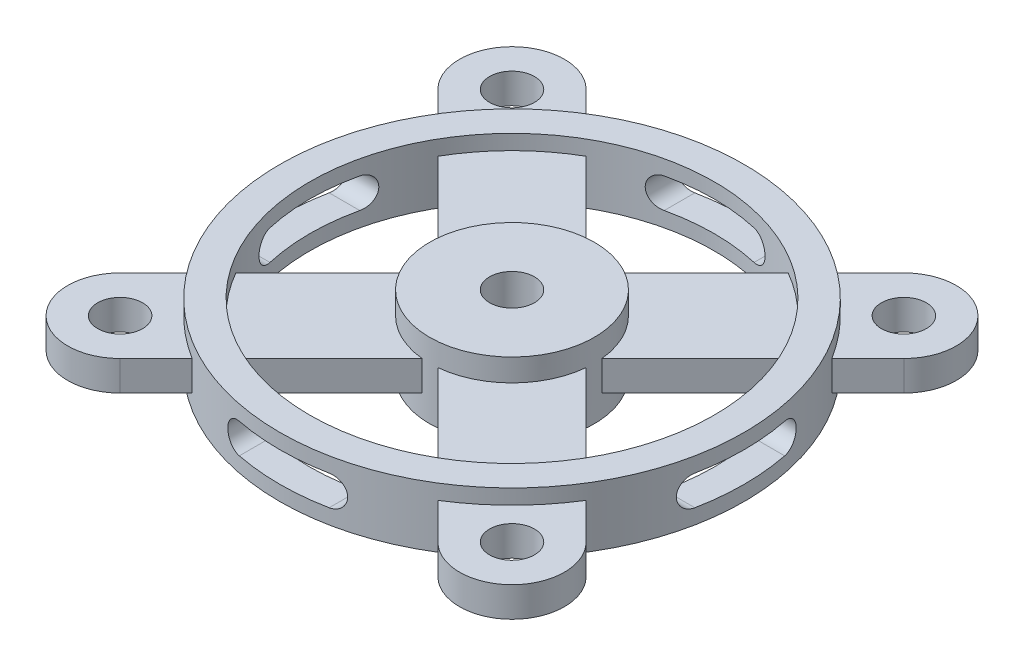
ISO-10303-21;
HEADER;
FILE_DESCRIPTION(('STEP AP214'),'2;1');
FILE_NAME('part.step','',(''),(''),'','','');
FILE_SCHEMA(('AUTOMOTIVE_DESIGN { 1 0 10303 214 1 1 1 1 }'));
ENDSEC;
DATA;
#1=APPLICATION_CONTEXT('core data for automotive mechanical design processes');
#2=APPLICATION_PROTOCOL_DEFINITION('international standard','automotive_design',2000,#1);
#3=PRODUCT_CONTEXT('',#1,'mechanical');
#4=PRODUCT('Part','Part','',(#3));
#5=PRODUCT_RELATED_PRODUCT_CATEGORY('part','',(#4));
#6=PRODUCT_DEFINITION_FORMATION('','',#4);
#7=PRODUCT_DEFINITION_CONTEXT('part definition',#1,'design');
#8=PRODUCT_DEFINITION('design','',#6,#7);
#9=PRODUCT_DEFINITION_SHAPE('','',#8);
#10=(LENGTH_UNIT() NAMED_UNIT(*) SI_UNIT(.MILLI.,.METRE.));
#11=(NAMED_UNIT(*) PLANE_ANGLE_UNIT() SI_UNIT($,.RADIAN.));
#12=(NAMED_UNIT(*) SI_UNIT($,.STERADIAN.) SOLID_ANGLE_UNIT());
#13=UNCERTAINTY_MEASURE_WITH_UNIT(LENGTH_MEASURE(1.E-05),#10,'distance_accuracy_value','');
#14=(GEOMETRIC_REPRESENTATION_CONTEXT(3) GLOBAL_UNCERTAINTY_ASSIGNED_CONTEXT((#13)) GLOBAL_UNIT_ASSIGNED_CONTEXT((#10,
#11,#12)) REPRESENTATION_CONTEXT('',''));
#15=CARTESIAN_POINT('',(0.,0.,0.));
#16=DIRECTION('',(0.,0.,1.));
#17=DIRECTION('',(1.,0.,0.));
#18=AXIS2_PLACEMENT_3D('',#15,#16,#17);
#19=CARTESIAN_POINT('',(0.,1.,0.));
#20=DIRECTION('',(0.,1.,0.));
#21=DIRECTION('',(0.,0.,1.));
#22=AXIS2_PLACEMENT_3D('',#19,#20,#21);
#23=PLANE('',#22);
#24=DIRECTION('',(0.707106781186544,0.,0.707106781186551));
#25=VECTOR('',#24,1.);
#26=CARTESIAN_POINT('',(-2.47487373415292,1.,2.4748737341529));
#27=LINE('',#26,#25);
#28=CARTESIAN_POINT('',(0.525126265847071,1.,5.47487373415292));
#29=VERTEX_POINT('',#28);
#30=CARTESIAN_POINT('',(6.74467072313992,1.,11.6944181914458));
#31=VERTEX_POINT('',#30);
#32=EDGE_CURVE('E477',#29,#31,#27,.T.);
#33=ORIENTED_EDGE('',*,*,#32,.F.);
#34=CARTESIAN_POINT('',(0.,1.,0.));
#35=DIRECTION('',(0.,1.,0.));
#36=DIRECTION('',(0.,0.,1.));
#37=AXIS2_PLACEMENT_3D('',#34,#35,#36);
#38=CIRCLE('',#37,5.5);
#39=CARTESIAN_POINT('',(5.47487373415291,1.,0.525126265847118));
#40=VERTEX_POINT('',#39);
#41=EDGE_CURVE('E775',#29,#40,#38,.T.);
#42=ORIENTED_EDGE('',*,*,#41,.T.);
#43=DIRECTION('',(0.707106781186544,0.,0.707106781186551));
#44=VECTOR('',#43,1.);
#45=CARTESIAN_POINT('',(2.47487373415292,1.,-2.4748737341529));
#46=LINE('',#45,#44);
#47=CARTESIAN_POINT('',(11.6944181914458,1.,6.74467072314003));
#48=VERTEX_POINT('',#47);
#49=EDGE_CURVE('E485',#40,#48,#46,.T.);
#50=ORIENTED_EDGE('',*,*,#49,.T.);
#51=CARTESIAN_POINT('',(0.,1.,0.));
#52=DIRECTION('',(0.,1.,0.));
#53=DIRECTION('',(0.,0.,1.));
#54=AXIS2_PLACEMENT_3D('',#51,#52,#53);
#55=CIRCLE('',#54,13.5);
#56=EDGE_CURVE('E58',#31,#48,#55,.T.);
#57=ORIENTED_EDGE('',*,*,#56,.F.);
#58=EDGE_LOOP('',(#33,#42,#50,#57));
#59=FACE_BOUND('',#58,.T.);
#60=ADVANCED_FACE('F47',(#59),#23,.F.);
#61=DIRECTION('',(-0.707106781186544,0.,0.707106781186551));
#62=VECTOR('',#61,1.);
#63=CARTESIAN_POINT('',(2.47487373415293,1.,2.4748737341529));
#64=LINE('',#63,#62);
#65=CARTESIAN_POINT('',(11.6944181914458,1.,-6.74467072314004));
#66=VERTEX_POINT('',#65);
#67=CARTESIAN_POINT('',(5.47487373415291,1.,-0.52512626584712));
#68=VERTEX_POINT('',#67);
#69=EDGE_CURVE('E436',#66,#68,#64,.T.);
#70=ORIENTED_EDGE('',*,*,#69,.T.);
#71=CARTESIAN_POINT('',(0.525126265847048,1.,-5.47487373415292));
#72=VERTEX_POINT('',#71);
#73=EDGE_CURVE('E362',#68,#72,#38,.T.);
#74=ORIENTED_EDGE('',*,*,#73,.T.);
#75=DIRECTION('',(-0.707106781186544,0.,0.707106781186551));
#76=VECTOR('',#75,1.);
#77=CARTESIAN_POINT('',(-2.47487373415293,1.,-2.47487373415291));
#78=LINE('',#77,#76);
#79=CARTESIAN_POINT('',(6.7446707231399,1.,-11.6944181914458));
#80=VERTEX_POINT('',#79);
#81=EDGE_CURVE('E445',#80,#72,#78,.T.);
#82=ORIENTED_EDGE('',*,*,#81,.F.);
#83=EDGE_CURVE('E722',#66,#80,#55,.T.);
#84=ORIENTED_EDGE('',*,*,#83,.F.);
#85=EDGE_LOOP('',(#70,#74,#82,#84));
#86=FACE_BOUND('',#85,.T.);
#87=ADVANCED_FACE('F822',(#86),#23,.F.);
#88=DIRECTION('',(0.707106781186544,0.,0.707106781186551));
#89=VECTOR('',#88,1.);
#90=CARTESIAN_POINT('',(2.47487373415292,1.,-2.4748737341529));
#91=LINE('',#90,#89);
#92=CARTESIAN_POINT('',(-6.74467072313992,1.,-11.6944181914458));
#93=VERTEX_POINT('',#92);
#94=CARTESIAN_POINT('',(-0.525126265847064,1.,-5.47487373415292));
#95=VERTEX_POINT('',#94);
#96=EDGE_CURVE('E450',#93,#95,#91,.T.);
#97=ORIENTED_EDGE('',*,*,#96,.T.);
#98=CARTESIAN_POINT('',(-5.47487373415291,1.,-0.525126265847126));
#99=VERTEX_POINT('',#98);
#100=EDGE_CURVE('E389',#95,#99,#38,.T.);
#101=ORIENTED_EDGE('',*,*,#100,.T.);
#102=DIRECTION('',(0.707106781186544,0.,0.707106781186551));
#103=VECTOR('',#102,1.);
#104=CARTESIAN_POINT('',(-2.47487373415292,1.,2.4748737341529));
#105=LINE('',#104,#103);
#106=CARTESIAN_POINT('',(-11.6944181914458,1.,-6.74467072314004));
#107=VERTEX_POINT('',#106);
#108=EDGE_CURVE('E459',#107,#99,#105,.T.);
#109=ORIENTED_EDGE('',*,*,#108,.F.);
#110=EDGE_CURVE('E735',#93,#107,#55,.T.);
#111=ORIENTED_EDGE('',*,*,#110,.F.);
#112=EDGE_LOOP('',(#97,#101,#109,#111));
#113=FACE_BOUND('',#112,.T.);
#114=ADVANCED_FACE('F839',(#113),#23,.F.);
#115=CARTESIAN_POINT('',(0.,3.,0.));
#116=DIRECTION('',(0.,1.,0.));
#117=DIRECTION('',(0.,0.,1.));
#118=AXIS2_PLACEMENT_3D('',#115,#116,#117);
#119=PLANE('',#118);
#120=CARTESIAN_POINT('',(0.,3.,0.));
#121=DIRECTION('',(0.,1.,0.));
#122=DIRECTION('',(0.,0.,1.));
#123=AXIS2_PLACEMENT_3D('',#120,#121,#122);
#124=CIRCLE('',#123,5.5);
#125=CARTESIAN_POINT('',(0.525126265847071,3.,5.47487373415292));
#126=VERTEX_POINT('',#125);
#127=CARTESIAN_POINT('',(5.47487373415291,3.,0.525126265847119));
#128=VERTEX_POINT('',#127);
#129=EDGE_CURVE('E378',#126,#128,#124,.T.);
#130=ORIENTED_EDGE('',*,*,#129,.F.);
#131=DIRECTION('',(0.707106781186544,0.,0.707106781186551));
#132=VECTOR('',#131,1.);
#133=CARTESIAN_POINT('',(-2.47487373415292,3.,2.4748737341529));
#134=LINE('',#133,#132);
#135=CARTESIAN_POINT('',(6.74467072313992,3.,11.6944181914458));
#136=VERTEX_POINT('',#135);
#137=EDGE_CURVE('E425',#126,#136,#134,.T.);
#138=ORIENTED_EDGE('',*,*,#137,.T.);
#139=CARTESIAN_POINT('',(0.,3.,0.));
#140=DIRECTION('',(0.,1.,0.));
#141=DIRECTION('',(0.,0.,1.));
#142=AXIS2_PLACEMENT_3D('',#139,#140,#141);
#143=CIRCLE('',#142,13.5);
#144=CARTESIAN_POINT('',(11.6944181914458,3.,6.74467072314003));
#145=VERTEX_POINT('',#144);
#146=EDGE_CURVE('E710',#136,#145,#143,.T.);
#147=ORIENTED_EDGE('',*,*,#146,.T.);
#148=DIRECTION('',(0.707106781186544,0.,0.707106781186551));
#149=VECTOR('',#148,1.);
#150=CARTESIAN_POINT('',(2.47487373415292,3.,-2.4748737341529));
#151=LINE('',#150,#149);
#152=EDGE_CURVE('E433',#128,#145,#151,.T.);
#153=ORIENTED_EDGE('',*,*,#152,.F.);
#154=EDGE_LOOP('',(#130,#138,#147,#153));
#155=FACE_BOUND('',#154,.T.);
#156=ADVANCED_FACE('F783',(#155),#119,.T.);
#157=CARTESIAN_POINT('',(5.47487373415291,3.,-0.525126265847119));
#158=VERTEX_POINT('',#157);
#159=CARTESIAN_POINT('',(0.525126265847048,3.,-5.47487373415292));
#160=VERTEX_POINT('',#159);
#161=EDGE_CURVE('E359',#158,#160,#124,.T.);
#162=ORIENTED_EDGE('',*,*,#161,.F.);
#163=DIRECTION('',(-0.707106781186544,0.,0.707106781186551));
#164=VECTOR('',#163,1.);
#165=CARTESIAN_POINT('',(2.47487373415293,3.,2.4748737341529));
#166=LINE('',#165,#164);
#167=CARTESIAN_POINT('',(11.6944181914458,3.,-6.74467072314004));
#168=VERTEX_POINT('',#167);
#169=EDGE_CURVE('E372',#168,#158,#166,.T.);
#170=ORIENTED_EDGE('',*,*,#169,.F.);
#171=CARTESIAN_POINT('',(6.7446707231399,3.,-11.6944181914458));
#172=VERTEX_POINT('',#171);
#173=EDGE_CURVE('E723',#168,#172,#143,.T.);
#174=ORIENTED_EDGE('',*,*,#173,.T.);
#175=DIRECTION('',(-0.707106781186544,0.,0.707106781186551));
#176=VECTOR('',#175,1.);
#177=CARTESIAN_POINT('',(-2.47487373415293,3.,-2.47487373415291));
#178=LINE('',#177,#176);
#179=EDGE_CURVE('E374',#172,#160,#178,.T.);
#180=ORIENTED_EDGE('',*,*,#179,.T.);
#181=EDGE_LOOP('',(#162,#170,#174,#180));
#182=FACE_BOUND('',#181,.T.);
#183=ADVANCED_FACE('F370',(#182),#119,.T.);
#184=CARTESIAN_POINT('',(-0.525126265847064,3.,-5.47487373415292));
#185=VERTEX_POINT('',#184);
#186=CARTESIAN_POINT('',(-5.47487373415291,3.,-0.525126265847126));
#187=VERTEX_POINT('',#186);
#188=EDGE_CURVE('E73',#185,#187,#124,.T.);
#189=ORIENTED_EDGE('',*,*,#188,.F.);
#190=DIRECTION('',(0.707106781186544,0.,0.707106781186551));
#191=VECTOR('',#190,1.);
#192=CARTESIAN_POINT('',(2.47487373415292,3.,-2.4748737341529));
#193=LINE('',#192,#191);
#194=CARTESIAN_POINT('',(-6.74467072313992,3.,-11.6944181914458));
#195=VERTEX_POINT('',#194);
#196=EDGE_CURVE('E399',#195,#185,#193,.T.);
#197=ORIENTED_EDGE('',*,*,#196,.F.);
#198=CARTESIAN_POINT('',(-11.6944181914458,3.,-6.74467072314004));
#199=VERTEX_POINT('',#198);
#200=EDGE_CURVE('E711',#195,#199,#143,.T.);
#201=ORIENTED_EDGE('',*,*,#200,.T.);
#202=DIRECTION('',(0.707106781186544,0.,0.707106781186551));
#203=VECTOR('',#202,1.);
#204=CARTESIAN_POINT('',(-2.47487373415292,3.,2.4748737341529));
#205=LINE('',#204,#203);
#206=EDGE_CURVE('E408',#199,#187,#205,.T.);
#207=ORIENTED_EDGE('',*,*,#206,.T.);
#208=EDGE_LOOP('',(#189,#197,#201,#207));
#209=FACE_BOUND('',#208,.T.);
#210=ADVANCED_FACE('F1071',(#209),#119,.T.);
#211=CARTESIAN_POINT('',(0.,4.,0.));
#212=DIRECTION('',(0.,-1.,0.));
#213=DIRECTION('',(0.,0.,-1.));
#214=AXIS2_PLACEMENT_3D('',#211,#212,#213);
#215=CYLINDRICAL_SURFACE('',#214,15.5);
#216=CARTESIAN_POINT('',(0.,1.,0.));
#217=DIRECTION('',(0.,1.,0.));
#218=DIRECTION('',(0.,0.,1.));
#219=AXIS2_PLACEMENT_3D('',#216,#217,#218);
#220=CIRCLE('',#219,15.5);
#221=CARTESIAN_POINT('',(13.1519519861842,1.,-8.20220451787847));
#222=VERTEX_POINT('',#221);
#223=CARTESIAN_POINT('',(8.20220451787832,1.,-13.1519519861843));
#224=VERTEX_POINT('',#223);
#225=EDGE_CURVE('E854',#222,#224,#220,.T.);
#226=ORIENTED_EDGE('',*,*,#225,.F.);
#227=DIRECTION('',(0.,-1.,0.));
#228=VECTOR('',#227,1.);
#229=CARTESIAN_POINT('',(13.1519519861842,4.,-8.20220451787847));
#230=LINE('',#229,#228);
#231=CARTESIAN_POINT('',(13.1519519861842,3.,-8.20220451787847));
#232=VERTEX_POINT('',#231);
#233=EDGE_CURVE('E554',#232,#222,#230,.T.);
#234=ORIENTED_EDGE('',*,*,#233,.F.);
#235=CARTESIAN_POINT('',(0.,3.,0.));
#236=DIRECTION('',(0.,1.,0.));
#237=DIRECTION('',(0.,0.,1.));
#238=AXIS2_PLACEMENT_3D('',#235,#236,#237);
#239=CIRCLE('',#238,15.5);
#240=CARTESIAN_POINT('',(8.20220451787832,3.,-13.1519519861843));
#241=VERTEX_POINT('',#240);
#242=EDGE_CURVE('E848',#232,#241,#239,.T.);
#243=ORIENTED_EDGE('',*,*,#242,.T.);
#244=DIRECTION('',(0.,-1.,0.));
#245=VECTOR('',#244,1.);
#246=CARTESIAN_POINT('',(8.20220451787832,4.,-13.1519519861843));
#247=LINE('',#246,#245);
#248=EDGE_CURVE('E527',#241,#224,#247,.T.);
#249=ORIENTED_EDGE('',*,*,#248,.T.);
#250=EDGE_LOOP('',(#226,#234,#243,#249));
#251=FACE_BOUND('',#250,.T.);
#252=CARTESIAN_POINT('',(-13.1519519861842,1.,8.20220451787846));
#253=VERTEX_POINT('',#252);
#254=CARTESIAN_POINT('',(-8.20220451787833,1.,13.1519519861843));
#255=VERTEX_POINT('',#254);
#256=EDGE_CURVE('E522',#253,#255,#220,.T.);
#257=ORIENTED_EDGE('',*,*,#256,.F.);
#258=DIRECTION('',(0.,-1.,0.));
#259=VECTOR('',#258,1.);
#260=CARTESIAN_POINT('',(-13.1519519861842,4.,8.20220451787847));
#261=LINE('',#260,#259);
#262=CARTESIAN_POINT('',(-13.1519519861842,3.,8.20220451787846));
#263=VERTEX_POINT('',#262);
#264=EDGE_CURVE('E538',#253,#263,#261,.F.);
#265=ORIENTED_EDGE('',*,*,#264,.T.);
#266=CARTESIAN_POINT('',(-8.20220451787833,3.,13.1519519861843));
#267=VERTEX_POINT('',#266);
#268=EDGE_CURVE('E493',#263,#267,#239,.T.);
#269=ORIENTED_EDGE('',*,*,#268,.T.);
#270=DIRECTION('',(0.,-1.,0.));
#271=VECTOR('',#270,1.);
#272=CARTESIAN_POINT('',(-8.20220451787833,4.,13.1519519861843));
#273=LINE('',#272,#271);
#274=EDGE_CURVE('E542',#255,#267,#273,.F.);
#275=ORIENTED_EDGE('',*,*,#274,.F.);
#276=EDGE_LOOP('',(#257,#265,#269,#275));
#277=FACE_BOUND('',#276,.T.);
#278=CARTESIAN_POINT('',(-15.2069063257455,1.,3.));
#279=CARTESIAN_POINT('',(-15.1955818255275,0.999958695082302,3.0574691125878));
#280=CARTESIAN_POINT('',(-15.1839108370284,1.00495119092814,3.11484978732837));
#281=CARTESIAN_POINT('',(-15.1602861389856,1.02462653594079,3.22783970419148));
#282=CARTESIAN_POINT('',(-15.148332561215,1.03930495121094,3.28344974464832));
#283=CARTESIAN_POINT('',(-15.1245376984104,1.07798226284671,3.39137806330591));
#284=CARTESIAN_POINT('',(-15.1126964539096,1.10198440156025,3.44369518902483));
#285=CARTESIAN_POINT('',(-15.0895980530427,1.1586554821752,3.54353648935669));
#286=CARTESIAN_POINT('',(-15.0783407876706,1.19132279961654,3.59106156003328));
#287=CARTESIAN_POINT('',(-15.0569245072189,1.26438176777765,3.67982460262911));
#288=CARTESIAN_POINT('',(-15.0467626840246,1.30475289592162,3.72107876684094));
#289=CARTESIAN_POINT('',(-15.0279908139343,1.39220402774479,3.79618150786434));
#290=CARTESIAN_POINT('',(-15.0193807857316,1.4392841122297,3.83002999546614));
#291=CARTESIAN_POINT('',(-15.0043412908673,1.53769800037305,3.88852640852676));
#292=CARTESIAN_POINT('',(-14.9978668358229,1.58891124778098,3.91336542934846));
#293=CARTESIAN_POINT('',(-14.9871927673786,1.695012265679,3.9540484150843));
#294=CARTESIAN_POINT('',(-14.9829925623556,1.74989907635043,3.96989471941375));
#295=CARTESIAN_POINT('',(-14.9772011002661,1.8599763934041,3.99168777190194));
#296=CARTESIAN_POINT('',(-14.9755336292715,1.91510572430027,3.99792379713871));
#297=CARTESIAN_POINT('',(-14.9746590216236,2.02565428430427,4.00119866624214));
#298=CARTESIAN_POINT('',(-14.9754516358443,2.08107348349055,3.99823844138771));
#299=CARTESIAN_POINT('',(-14.9794178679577,2.18966322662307,3.98335244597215));
#300=CARTESIAN_POINT('',(-14.9825518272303,2.24285581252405,3.97157600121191));
#301=CARTESIAN_POINT('',(-14.990984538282,2.34647156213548,3.93962604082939));
#302=CARTESIAN_POINT('',(-14.9962833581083,2.39689463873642,3.91945226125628));
#303=CARTESIAN_POINT('',(-15.0088361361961,2.4941160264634,3.87110639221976));
#304=CARTESIAN_POINT('',(-15.01610910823,2.54087306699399,3.84285636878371));
#305=CARTESIAN_POINT('',(-15.0322309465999,2.62900315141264,3.77929949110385));
#306=CARTESIAN_POINT('',(-15.0410799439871,2.67037574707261,3.74399204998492));
#307=CARTESIAN_POINT('',(-15.0602258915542,2.74781910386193,3.66622981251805));
#308=CARTESIAN_POINT('',(-15.0705567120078,2.78370684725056,3.62360113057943));
#309=CARTESIAN_POINT('',(-15.0920279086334,2.84786400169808,3.5331082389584));
#310=CARTESIAN_POINT('',(-15.1031686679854,2.87612977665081,3.48524154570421));
#311=CARTESIAN_POINT('',(-15.1261365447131,2.92500566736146,3.3841913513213));
#312=CARTESIAN_POINT('',(-15.1379741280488,2.94538176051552,3.33089722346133));
#313=CARTESIAN_POINT('',(-15.1615970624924,2.97677386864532,3.22165843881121));
#314=CARTESIAN_POINT('',(-15.1733824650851,2.98780375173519,3.1657178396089));
#315=CARTESIAN_POINT('',(-15.1886561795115,2.99600745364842,3.09112782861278));
#316=CARTESIAN_POINT('',(-15.192349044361,2.99750494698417,3.07292661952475));
#317=CARTESIAN_POINT('',(-15.1996737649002,2.99949991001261,3.0364882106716));
#318=CARTESIAN_POINT('',(-15.2033057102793,2.99999900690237,3.01825111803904));
#319=CARTESIAN_POINT('',(-15.2069063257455,3.,3.));
#320=B_SPLINE_CURVE_WITH_KNOTS('',3,(#278,#279,#280,#281,#282,#283,#284,#285,#286,#287,#288,
#289,#290,#291,#292,#293,#294,#295,#296,#297,#298,#299,#300,#301,#302,#303,#304,#305,#306,#307,
#308,#309,#310,#311,#312,#313,#314,#315,#316,#317,#318,#319),.UNSPECIFIED.,.F.,.F.,(4,2,2,2,2,2,
2,2,2,2,2,2,2,2,2,2,2,2,2,2,4),(0.,0.175482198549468,0.35088412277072,0.526347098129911,
0.701777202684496,0.876746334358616,1.05171757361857,1.22272417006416,1.39368625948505,
1.55939414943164,1.725085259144,1.88803170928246,2.05098328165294,2.2155636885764,
2.38015778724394,2.54940647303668,2.71873575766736,2.89276047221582,3.06652651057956,
3.12240429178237,3.17819092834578),.UNSPECIFIED.);
#321=CARTESIAN_POINT('',(-15.2069063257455,1.,3.));
#322=VERTEX_POINT('',#321);
#323=CARTESIAN_POINT('',(-15.2069063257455,3.,3.));
#324=VERTEX_POINT('',#323);
#325=EDGE_CURVE('E871',#322,#324,#320,.T.);
#326=ORIENTED_EDGE('',*,*,#325,.F.);
#327=CARTESIAN_POINT('',(0.,1.,0.));
#328=DIRECTION('',(0.,1.,0.));
#329=DIRECTION('',(0.,0.,1.));
#330=AXIS2_PLACEMENT_3D('',#327,#328,#329);
#331=CIRCLE('',#330,15.5);
#332=CARTESIAN_POINT('',(-15.2069063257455,1.,-3.));
#333=VERTEX_POINT('',#332);
#334=EDGE_CURVE('E867',#333,#322,#331,.T.);
#335=ORIENTED_EDGE('',*,*,#334,.F.);
#336=CARTESIAN_POINT('',(-15.2069063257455,3.,-3.));
#337=CARTESIAN_POINT('',(-15.1955818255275,3.0000413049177,-3.0574691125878));
#338=CARTESIAN_POINT('',(-15.1839108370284,2.99504880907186,-3.11484978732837));
#339=CARTESIAN_POINT('',(-15.1602861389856,2.97537346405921,-3.22783970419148));
#340=CARTESIAN_POINT('',(-15.148332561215,2.96069504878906,-3.28344974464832));
#341=CARTESIAN_POINT('',(-15.1245376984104,2.92201773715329,-3.39137806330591));
#342=CARTESIAN_POINT('',(-15.1126964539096,2.89801559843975,-3.44369518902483));
#343=CARTESIAN_POINT('',(-15.0895980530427,2.8413445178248,-3.54353648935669));
#344=CARTESIAN_POINT('',(-15.0783407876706,2.80867720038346,-3.59106156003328));
#345=CARTESIAN_POINT('',(-15.0569245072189,2.73561823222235,-3.67982460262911));
#346=CARTESIAN_POINT('',(-15.0467626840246,2.69524710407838,-3.72107876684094));
#347=CARTESIAN_POINT('',(-15.0279908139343,2.60779597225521,-3.79618150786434));
#348=CARTESIAN_POINT('',(-15.0193807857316,2.5607158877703,-3.83002999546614));
#349=CARTESIAN_POINT('',(-15.0043412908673,2.46230199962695,-3.88852640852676));
#350=CARTESIAN_POINT('',(-14.9978668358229,2.41108875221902,-3.91336542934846));
#351=CARTESIAN_POINT('',(-14.9871927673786,2.304987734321,-3.9540484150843));
#352=CARTESIAN_POINT('',(-14.9829925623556,2.25010092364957,-3.96989471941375));
#353=CARTESIAN_POINT('',(-14.9772011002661,2.1400236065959,-3.99168777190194));
#354=CARTESIAN_POINT('',(-14.9755336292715,2.08489427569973,-3.99792379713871));
#355=CARTESIAN_POINT('',(-14.9746590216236,1.97434571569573,-4.00119866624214));
#356=CARTESIAN_POINT('',(-14.9754516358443,1.91892651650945,-3.99823844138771));
#357=CARTESIAN_POINT('',(-14.9794178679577,1.81033677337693,-3.98335244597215));
#358=CARTESIAN_POINT('',(-14.9825518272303,1.75714418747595,-3.97157600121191));
#359=CARTESIAN_POINT('',(-14.990984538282,1.65352843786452,-3.93962604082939));
#360=CARTESIAN_POINT('',(-14.9962833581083,1.60310536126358,-3.91945226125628));
#361=CARTESIAN_POINT('',(-15.0088361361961,1.5058839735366,-3.87110639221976));
#362=CARTESIAN_POINT('',(-15.01610910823,1.45912693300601,-3.84285636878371));
#363=CARTESIAN_POINT('',(-15.0322309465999,1.37099684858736,-3.77929949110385));
#364=CARTESIAN_POINT('',(-15.0410799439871,1.32962425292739,-3.74399204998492));
#365=CARTESIAN_POINT('',(-15.0602258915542,1.25218089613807,-3.66622981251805));
#366=CARTESIAN_POINT('',(-15.0705567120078,1.21629315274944,-3.62360113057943));
#367=CARTESIAN_POINT('',(-15.0920279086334,1.15213599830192,-3.5331082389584));
#368=CARTESIAN_POINT('',(-15.1031686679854,1.12387022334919,-3.4852415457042));
#369=CARTESIAN_POINT('',(-15.1261365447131,1.07499433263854,-3.3841913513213));
#370=CARTESIAN_POINT('',(-15.1379741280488,1.05461823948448,-3.33089722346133));
#371=CARTESIAN_POINT('',(-15.1615970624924,1.02322613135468,-3.22165843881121));
#372=CARTESIAN_POINT('',(-15.1733824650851,1.01219624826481,-3.1657178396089));
#373=CARTESIAN_POINT('',(-15.1886561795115,1.00399254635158,-3.09112782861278));
#374=CARTESIAN_POINT('',(-15.192349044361,1.00249505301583,-3.07292661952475));
#375=CARTESIAN_POINT('',(-15.1996737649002,1.00050008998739,-3.0364882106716));
#376=CARTESIAN_POINT('',(-15.2033057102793,1.00000099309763,-3.01825111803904));
#377=CARTESIAN_POINT('',(-15.2069063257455,1.,-3.));
#378=B_SPLINE_CURVE_WITH_KNOTS('',3,(#336,#337,#338,#339,#340,#341,#342,#343,#344,#345,#346,
#347,#348,#349,#350,#351,#352,#353,#354,#355,#356,#357,#358,#359,#360,#361,#362,#363,#364,#365,
#366,#367,#368,#369,#370,#371,#372,#373,#374,#375,#376,#377),.UNSPECIFIED.,.F.,.F.,(4,2,2,2,2,2,
2,2,2,2,2,2,2,2,2,2,2,2,2,2,4),(0.,0.175482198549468,0.35088412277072,0.526347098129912,
0.701777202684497,0.876746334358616,1.05171757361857,1.22272417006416,1.39368625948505,
1.55939414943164,1.725085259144,1.88803170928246,2.05098328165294,2.2155636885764,
2.38015778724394,2.54940647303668,2.71873575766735,2.89276047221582,3.06652651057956,
3.12240429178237,3.17819092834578),.UNSPECIFIED.);
#379=CARTESIAN_POINT('',(-15.2069063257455,3.,-3.));
#380=VERTEX_POINT('',#379);
#381=EDGE_CURVE('E580',#380,#333,#378,.T.);
#382=ORIENTED_EDGE('',*,*,#381,.F.);
#383=CARTESIAN_POINT('',(0.,3.,0.));
#384=DIRECTION('',(0.,-1.,0.));
#385=DIRECTION('',(0.,0.,-1.));
#386=AXIS2_PLACEMENT_3D('',#383,#384,#385);
#387=CIRCLE('',#386,15.5);
#388=EDGE_CURVE('E576',#324,#380,#387,.T.);
#389=ORIENTED_EDGE('',*,*,#388,.F.);
#390=EDGE_LOOP('',(#326,#335,#382,#389));
#391=FACE_BOUND('',#390,.T.);
#392=CARTESIAN_POINT('',(-3.,1.,-15.2069063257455));
#393=CARTESIAN_POINT('',(-3.0574691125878,0.999958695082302,-15.1955818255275));
#394=CARTESIAN_POINT('',(-3.11484978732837,1.00495119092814,-15.1839108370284));
#395=CARTESIAN_POINT('',(-3.22783970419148,1.02462653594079,-15.1602861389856));
#396=CARTESIAN_POINT('',(-3.28344974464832,1.03930495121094,-15.148332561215));
#397=CARTESIAN_POINT('',(-3.39137806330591,1.07798226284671,-15.1245376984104));
#398=CARTESIAN_POINT('',(-3.44369518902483,1.10198440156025,-15.1126964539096));
#399=CARTESIAN_POINT('',(-3.54353648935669,1.1586554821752,-15.0895980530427));
#400=CARTESIAN_POINT('',(-3.59106156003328,1.19132279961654,-15.0783407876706));
#401=CARTESIAN_POINT('',(-3.67982460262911,1.26438176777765,-15.0569245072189));
#402=CARTESIAN_POINT('',(-3.72107876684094,1.30475289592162,-15.0467626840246));
#403=CARTESIAN_POINT('',(-3.79618150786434,1.39220402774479,-15.0279908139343));
#404=CARTESIAN_POINT('',(-3.83002999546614,1.4392841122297,-15.0193807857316));
#405=CARTESIAN_POINT('',(-3.88852640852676,1.53769800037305,-15.0043412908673));
#406=CARTESIAN_POINT('',(-3.91336542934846,1.58891124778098,-14.9978668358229));
#407=CARTESIAN_POINT('',(-3.9540484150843,1.695012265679,-14.9871927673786));
#408=CARTESIAN_POINT('',(-3.96989471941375,1.74989907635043,-14.9829925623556));
#409=CARTESIAN_POINT('',(-3.99168777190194,1.8599763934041,-14.9772011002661));
#410=CARTESIAN_POINT('',(-3.99792379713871,1.91510572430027,-14.9755336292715));
#411=CARTESIAN_POINT('',(-4.00119866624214,2.02565428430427,-14.9746590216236));
#412=CARTESIAN_POINT('',(-3.99823844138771,2.08107348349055,-14.9754516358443));
#413=CARTESIAN_POINT('',(-3.98335244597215,2.18966322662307,-14.9794178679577));
#414=CARTESIAN_POINT('',(-3.97157600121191,2.24285581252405,-14.9825518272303));
#415=CARTESIAN_POINT('',(-3.93962604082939,2.34647156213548,-14.990984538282));
#416=CARTESIAN_POINT('',(-3.91945226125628,2.39689463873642,-14.9962833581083));
#417=CARTESIAN_POINT('',(-3.87110639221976,2.4941160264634,-15.0088361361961));
#418=CARTESIAN_POINT('',(-3.84285636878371,2.54087306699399,-15.01610910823));
#419=CARTESIAN_POINT('',(-3.77929949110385,2.62900315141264,-15.0322309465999));
#420=CARTESIAN_POINT('',(-3.74399204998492,2.67037574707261,-15.0410799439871));
#421=CARTESIAN_POINT('',(-3.66622981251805,2.74781910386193,-15.0602258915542));
#422=CARTESIAN_POINT('',(-3.62360113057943,2.78370684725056,-15.0705567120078));
#423=CARTESIAN_POINT('',(-3.5331082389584,2.84786400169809,-15.0920279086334));
#424=CARTESIAN_POINT('',(-3.4852415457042,2.87612977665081,-15.1031686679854));
#425=CARTESIAN_POINT('',(-3.3841913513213,2.92500566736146,-15.1261365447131));
#426=CARTESIAN_POINT('',(-3.33089722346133,2.94538176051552,-15.1379741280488));
#427=CARTESIAN_POINT('',(-3.22165843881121,2.97677386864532,-15.1615970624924));
#428=CARTESIAN_POINT('',(-3.1657178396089,2.98780375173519,-15.1733824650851));
#429=CARTESIAN_POINT('',(-3.09112782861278,2.99600745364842,-15.1886561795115));
#430=CARTESIAN_POINT('',(-3.07292661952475,2.99750494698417,-15.192349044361));
#431=CARTESIAN_POINT('',(-3.0364882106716,2.99949991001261,-15.1996737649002));
#432=CARTESIAN_POINT('',(-3.01825111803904,2.99999900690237,-15.2033057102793));
#433=CARTESIAN_POINT('',(-3.,3.,-15.2069063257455));
#434=B_SPLINE_CURVE_WITH_KNOTS('',3,(#392,#393,#394,#395,#396,#397,#398,#399,#400,#401,#402,
#403,#404,#405,#406,#407,#408,#409,#410,#411,#412,#413,#414,#415,#416,#417,#418,#419,#420,#421,
#422,#423,#424,#425,#426,#427,#428,#429,#430,#431,#432,#433),.UNSPECIFIED.,.F.,.F.,(4,2,2,2,2,2,
2,2,2,2,2,2,2,2,2,2,2,2,2,2,4),(0.,0.175482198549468,0.35088412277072,0.526347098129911,
0.701777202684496,0.876746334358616,1.05171757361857,1.22272417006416,1.39368625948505,
1.55939414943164,1.725085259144,1.88803170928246,2.05098328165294,2.2155636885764,
2.38015778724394,2.54940647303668,2.71873575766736,2.89276047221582,3.06652651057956,
3.12240429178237,3.17819092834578),.UNSPECIFIED.);
#435=CARTESIAN_POINT('',(-3.,1.,-15.2069063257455));
#436=VERTEX_POINT('',#435);
#437=CARTESIAN_POINT('',(-3.,3.,-15.2069063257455));
#438=VERTEX_POINT('',#437);
#439=EDGE_CURVE('E921',#436,#438,#434,.T.);
#440=ORIENTED_EDGE('',*,*,#439,.F.);
#441=CARTESIAN_POINT('',(0.,1.,0.));
#442=DIRECTION('',(0.,1.,0.));
#443=DIRECTION('',(-1.,0.,0.));
#444=AXIS2_PLACEMENT_3D('',#441,#442,#443);
#445=CIRCLE('',#444,15.5);
#446=CARTESIAN_POINT('',(3.,1.,-15.2069063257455));
#447=VERTEX_POINT('',#446);
#448=EDGE_CURVE('E915',#447,#436,#445,.T.);
#449=ORIENTED_EDGE('',*,*,#448,.F.);
#450=CARTESIAN_POINT('',(3.,3.,-15.2069063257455));
#451=CARTESIAN_POINT('',(3.0574691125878,3.0000413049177,-15.1955818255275));
#452=CARTESIAN_POINT('',(3.11484978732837,2.99504880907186,-15.1839108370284));
#453=CARTESIAN_POINT('',(3.22783970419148,2.97537346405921,-15.1602861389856));
#454=CARTESIAN_POINT('',(3.28344974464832,2.96069504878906,-15.148332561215));
#455=CARTESIAN_POINT('',(3.39137806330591,2.92201773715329,-15.1245376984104));
#456=CARTESIAN_POINT('',(3.44369518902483,2.89801559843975,-15.1126964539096));
#457=CARTESIAN_POINT('',(3.54353648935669,2.8413445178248,-15.0895980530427));
#458=CARTESIAN_POINT('',(3.59106156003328,2.80867720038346,-15.0783407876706));
#459=CARTESIAN_POINT('',(3.67982460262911,2.73561823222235,-15.0569245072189));
#460=CARTESIAN_POINT('',(3.72107876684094,2.69524710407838,-15.0467626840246));
#461=CARTESIAN_POINT('',(3.79618150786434,2.60779597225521,-15.0279908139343));
#462=CARTESIAN_POINT('',(3.83002999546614,2.5607158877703,-15.0193807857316));
#463=CARTESIAN_POINT('',(3.88852640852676,2.46230199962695,-15.0043412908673));
#464=CARTESIAN_POINT('',(3.91336542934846,2.41108875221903,-14.9978668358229));
#465=CARTESIAN_POINT('',(3.9540484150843,2.304987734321,-14.9871927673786));
#466=CARTESIAN_POINT('',(3.96989471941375,2.25010092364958,-14.9829925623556));
#467=CARTESIAN_POINT('',(3.99168777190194,2.1400236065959,-14.9772011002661));
#468=CARTESIAN_POINT('',(3.99792379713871,2.08489427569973,-14.9755336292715));
#469=CARTESIAN_POINT('',(4.00119866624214,1.97434571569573,-14.9746590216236));
#470=CARTESIAN_POINT('',(3.99823844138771,1.91892651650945,-14.9754516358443));
#471=CARTESIAN_POINT('',(3.98335244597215,1.81033677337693,-14.9794178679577));
#472=CARTESIAN_POINT('',(3.97157600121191,1.75714418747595,-14.9825518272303));
#473=CARTESIAN_POINT('',(3.93962604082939,1.65352843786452,-14.990984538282));
#474=CARTESIAN_POINT('',(3.91945226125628,1.60310536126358,-14.9962833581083));
#475=CARTESIAN_POINT('',(3.87110639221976,1.5058839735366,-15.0088361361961));
#476=CARTESIAN_POINT('',(3.84285636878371,1.45912693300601,-15.01610910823));
#477=CARTESIAN_POINT('',(3.77929949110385,1.37099684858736,-15.0322309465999));
#478=CARTESIAN_POINT('',(3.74399204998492,1.32962425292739,-15.0410799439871));
#479=CARTESIAN_POINT('',(3.66622981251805,1.25218089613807,-15.0602258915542));
#480=CARTESIAN_POINT('',(3.62360113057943,1.21629315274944,-15.0705567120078));
#481=CARTESIAN_POINT('',(3.5331082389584,1.15213599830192,-15.0920279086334));
#482=CARTESIAN_POINT('',(3.4852415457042,1.12387022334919,-15.1031686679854));
#483=CARTESIAN_POINT('',(3.3841913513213,1.07499433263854,-15.1261365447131));
#484=CARTESIAN_POINT('',(3.33089722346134,1.05461823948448,-15.1379741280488));
#485=CARTESIAN_POINT('',(3.22165843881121,1.02322613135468,-15.1615970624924));
#486=CARTESIAN_POINT('',(3.1657178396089,1.01219624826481,-15.1733824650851));
#487=CARTESIAN_POINT('',(3.09112782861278,1.00399254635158,-15.1886561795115));
#488=CARTESIAN_POINT('',(3.07292661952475,1.00249505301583,-15.192349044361));
#489=CARTESIAN_POINT('',(3.0364882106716,1.00050008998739,-15.1996737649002));
#490=CARTESIAN_POINT('',(3.01825111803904,1.00000099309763,-15.2033057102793));
#491=CARTESIAN_POINT('',(3.,1.,-15.2069063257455));
#492=B_SPLINE_CURVE_WITH_KNOTS('',3,(#450,#451,#452,#453,#454,#455,#456,#457,#458,#459,#460,
#461,#462,#463,#464,#465,#466,#467,#468,#469,#470,#471,#472,#473,#474,#475,#476,#477,#478,#479,
#480,#481,#482,#483,#484,#485,#486,#487,#488,#489,#490,#491),.UNSPECIFIED.,.F.,.F.,(4,2,2,2,2,2,
2,2,2,2,2,2,2,2,2,2,2,2,2,2,4),(0.,0.175482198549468,0.35088412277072,0.526347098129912,
0.701777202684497,0.876746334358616,1.05171757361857,1.22272417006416,1.39368625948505,
1.55939414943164,1.725085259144,1.88803170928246,2.05098328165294,2.2155636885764,
2.38015778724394,2.54940647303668,2.71873575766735,2.89276047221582,3.06652651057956,
3.12240429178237,3.17819092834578),.UNSPECIFIED.);
#493=CARTESIAN_POINT('',(3.,3.,-15.2069063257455));
#494=VERTEX_POINT('',#493);
#495=EDGE_CURVE('E909',#494,#447,#492,.T.);
#496=ORIENTED_EDGE('',*,*,#495,.F.);
#497=CARTESIAN_POINT('',(0.,3.,0.));
#498=DIRECTION('',(0.,-1.,0.));
#499=DIRECTION('',(1.,0.,0.));
#500=AXIS2_PLACEMENT_3D('',#497,#498,#499);
#501=CIRCLE('',#500,15.5);
#502=EDGE_CURVE('E904',#438,#494,#501,.T.);
#503=ORIENTED_EDGE('',*,*,#502,.F.);
#504=EDGE_LOOP('',(#440,#449,#496,#503));
#505=FACE_BOUND('',#504,.T.);
#506=CARTESIAN_POINT('',(0.,4.,0.));
#507=DIRECTION('',(0.,1.,0.));
#508=DIRECTION('',(0.,0.,1.));
#509=AXIS2_PLACEMENT_3D('',#506,#507,#508);
#510=CIRCLE('',#509,15.5);
#511=CARTESIAN_POINT('',(0.,4.,15.5));
#512=VERTEX_POINT('',#511);
#513=EDGE_CURVE('E939',#512,#512,#510,.T.);
#514=ORIENTED_EDGE('',*,*,#513,.F.);
#515=EDGE_LOOP('',(#514));
#516=FACE_BOUND('',#515,.T.);
#517=CARTESIAN_POINT('',(0.,0.,0.));
#518=DIRECTION('',(0.,1.,0.));
#519=DIRECTION('',(0.,0.,1.));
#520=AXIS2_PLACEMENT_3D('',#517,#518,#519);
#521=CIRCLE('',#520,15.5);
#522=CARTESIAN_POINT('',(0.,0.,15.5));
#523=VERTEX_POINT('',#522);
#524=EDGE_CURVE('E935',#523,#523,#521,.T.);
#525=ORIENTED_EDGE('',*,*,#524,.T.);
#526=EDGE_LOOP('',(#525));
#527=FACE_BOUND('',#526,.T.);
#528=CARTESIAN_POINT('',(-3.,3.,15.2069063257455));
#529=CARTESIAN_POINT('',(-3.0574691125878,3.0000413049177,15.1955818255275));
#530=CARTESIAN_POINT('',(-3.11484978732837,2.99504880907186,15.1839108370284));
#531=CARTESIAN_POINT('',(-3.22783970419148,2.97537346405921,15.1602861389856));
#532=CARTESIAN_POINT('',(-3.28344974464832,2.96069504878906,15.148332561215));
#533=CARTESIAN_POINT('',(-3.39137806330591,2.92201773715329,15.1245376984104));
#534=CARTESIAN_POINT('',(-3.44369518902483,2.89801559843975,15.1126964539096));
#535=CARTESIAN_POINT('',(-3.54353648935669,2.8413445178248,15.0895980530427));
#536=CARTESIAN_POINT('',(-3.59106156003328,2.80867720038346,15.0783407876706));
#537=CARTESIAN_POINT('',(-3.67982460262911,2.73561823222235,15.0569245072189));
#538=CARTESIAN_POINT('',(-3.72107876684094,2.69524710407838,15.0467626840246));
#539=CARTESIAN_POINT('',(-3.79618150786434,2.60779597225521,15.0279908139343));
#540=CARTESIAN_POINT('',(-3.83002999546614,2.5607158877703,15.0193807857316));
#541=CARTESIAN_POINT('',(-3.88852640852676,2.46230199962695,15.0043412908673));
#542=CARTESIAN_POINT('',(-3.91336542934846,2.41108875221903,14.9978668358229));
#543=CARTESIAN_POINT('',(-3.9540484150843,2.304987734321,14.9871927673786));
#544=CARTESIAN_POINT('',(-3.96989471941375,2.25010092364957,14.9829925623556));
#545=CARTESIAN_POINT('',(-3.99168777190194,2.1400236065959,14.9772011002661));
#546=CARTESIAN_POINT('',(-3.99792379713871,2.08489427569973,14.9755336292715));
#547=CARTESIAN_POINT('',(-4.00119866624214,1.97434571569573,14.9746590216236));
#548=CARTESIAN_POINT('',(-3.99823844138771,1.91892651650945,14.9754516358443));
#549=CARTESIAN_POINT('',(-3.98335244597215,1.81033677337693,14.9794178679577));
#550=CARTESIAN_POINT('',(-3.97157600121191,1.75714418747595,14.9825518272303));
#551=CARTESIAN_POINT('',(-3.93962604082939,1.65352843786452,14.990984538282));
#552=CARTESIAN_POINT('',(-3.91945226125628,1.60310536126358,14.9962833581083));
#553=CARTESIAN_POINT('',(-3.87110639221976,1.5058839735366,15.0088361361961));
#554=CARTESIAN_POINT('',(-3.84285636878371,1.45912693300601,15.01610910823));
#555=CARTESIAN_POINT('',(-3.77929949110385,1.37099684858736,15.0322309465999));
#556=CARTESIAN_POINT('',(-3.74399204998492,1.32962425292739,15.0410799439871));
#557=CARTESIAN_POINT('',(-3.66622981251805,1.25218089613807,15.0602258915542));
#558=CARTESIAN_POINT('',(-3.62360113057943,1.21629315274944,15.0705567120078));
#559=CARTESIAN_POINT('',(-3.5331082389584,1.15213599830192,15.0920279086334));
#560=CARTESIAN_POINT('',(-3.4852415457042,1.12387022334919,15.1031686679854));
#561=CARTESIAN_POINT('',(-3.3841913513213,1.07499433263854,15.1261365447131));
#562=CARTESIAN_POINT('',(-3.33089722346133,1.05461823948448,15.1379741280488));
#563=CARTESIAN_POINT('',(-3.22165843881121,1.02322613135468,15.1615970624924));
#564=CARTESIAN_POINT('',(-3.1657178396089,1.01219624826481,15.1733824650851));
#565=CARTESIAN_POINT('',(-3.09112782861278,1.00399254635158,15.1886561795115));
#566=CARTESIAN_POINT('',(-3.07292661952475,1.00249505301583,15.192349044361));
#567=CARTESIAN_POINT('',(-3.0364882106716,1.00050008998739,15.1996737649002));
#568=CARTESIAN_POINT('',(-3.01825111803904,1.00000099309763,15.2033057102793));
#569=CARTESIAN_POINT('',(-3.,1.,15.2069063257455));
#570=B_SPLINE_CURVE_WITH_KNOTS('',3,(#528,#529,#530,#531,#532,#533,#534,#535,#536,#537,#538,
#539,#540,#541,#542,#543,#544,#545,#546,#547,#548,#549,#550,#551,#552,#553,#554,#555,#556,#557,
#558,#559,#560,#561,#562,#563,#564,#565,#566,#567,#568,#569),.UNSPECIFIED.,.F.,.F.,(4,2,2,2,2,2,
2,2,2,2,2,2,2,2,2,2,2,2,2,2,4),(0.,0.175482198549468,0.35088412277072,0.526347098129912,
0.701777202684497,0.876746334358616,1.05171757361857,1.22272417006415,1.39368625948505,
1.55939414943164,1.725085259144,1.88803170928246,2.05098328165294,2.2155636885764,
2.38015778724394,2.54940647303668,2.71873575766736,2.89276047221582,3.06652651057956,
3.12240429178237,3.17819092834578),.UNSPECIFIED.);
#571=CARTESIAN_POINT('',(-3.,3.,15.2069063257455));
#572=VERTEX_POINT('',#571);
#573=CARTESIAN_POINT('',(-3.,1.,15.2069063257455));
#574=VERTEX_POINT('',#573);
#575=EDGE_CURVE('E924',#572,#574,#570,.T.);
#576=ORIENTED_EDGE('',*,*,#575,.F.);
#577=CARTESIAN_POINT('',(3.,3.,15.2069063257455));
#578=VERTEX_POINT('',#577);
#579=EDGE_CURVE('E906',#578,#572,#501,.T.);
#580=ORIENTED_EDGE('',*,*,#579,.F.);
#581=CARTESIAN_POINT('',(3.,1.,15.2069063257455));
#582=CARTESIAN_POINT('',(3.0574691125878,0.999958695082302,15.1955818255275));
#583=CARTESIAN_POINT('',(3.11484978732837,1.00495119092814,15.1839108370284));
#584=CARTESIAN_POINT('',(3.22783970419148,1.02462653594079,15.1602861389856));
#585=CARTESIAN_POINT('',(3.28344974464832,1.03930495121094,15.148332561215));
#586=CARTESIAN_POINT('',(3.39137806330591,1.07798226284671,15.1245376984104));
#587=CARTESIAN_POINT('',(3.44369518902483,1.10198440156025,15.1126964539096));
#588=CARTESIAN_POINT('',(3.54353648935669,1.1586554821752,15.0895980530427));
#589=CARTESIAN_POINT('',(3.59106156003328,1.19132279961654,15.0783407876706));
#590=CARTESIAN_POINT('',(3.67982460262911,1.26438176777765,15.0569245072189));
#591=CARTESIAN_POINT('',(3.72107876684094,1.30475289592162,15.0467626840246));
#592=CARTESIAN_POINT('',(3.79618150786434,1.39220402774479,15.0279908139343));
#593=CARTESIAN_POINT('',(3.83002999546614,1.4392841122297,15.0193807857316));
#594=CARTESIAN_POINT('',(3.88852640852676,1.53769800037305,15.0043412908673));
#595=CARTESIAN_POINT('',(3.91336542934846,1.58891124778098,14.9978668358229));
#596=CARTESIAN_POINT('',(3.9540484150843,1.695012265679,14.9871927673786));
#597=CARTESIAN_POINT('',(3.96989471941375,1.74989907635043,14.9829925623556));
#598=CARTESIAN_POINT('',(3.99168777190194,1.8599763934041,14.9772011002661));
#599=CARTESIAN_POINT('',(3.99792379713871,1.91510572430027,14.9755336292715));
#600=CARTESIAN_POINT('',(4.00119866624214,2.02565428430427,14.9746590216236));
#601=CARTESIAN_POINT('',(3.99823844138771,2.08107348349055,14.9754516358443));
#602=CARTESIAN_POINT('',(3.98335244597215,2.18966322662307,14.9794178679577));
#603=CARTESIAN_POINT('',(3.97157600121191,2.24285581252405,14.9825518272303));
#604=CARTESIAN_POINT('',(3.93962604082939,2.34647156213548,14.990984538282));
#605=CARTESIAN_POINT('',(3.91945226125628,2.39689463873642,14.9962833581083));
#606=CARTESIAN_POINT('',(3.87110639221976,2.4941160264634,15.0088361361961));
#607=CARTESIAN_POINT('',(3.84285636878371,2.54087306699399,15.01610910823));
#608=CARTESIAN_POINT('',(3.77929949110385,2.62900315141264,15.0322309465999));
#609=CARTESIAN_POINT('',(3.74399204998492,2.67037574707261,15.0410799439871));
#610=CARTESIAN_POINT('',(3.66622981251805,2.74781910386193,15.0602258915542));
#611=CARTESIAN_POINT('',(3.62360113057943,2.78370684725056,15.0705567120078));
#612=CARTESIAN_POINT('',(3.5331082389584,2.84786400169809,15.0920279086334));
#613=CARTESIAN_POINT('',(3.4852415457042,2.87612977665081,15.1031686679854));
#614=CARTESIAN_POINT('',(3.3841913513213,2.92500566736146,15.1261365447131));
#615=CARTESIAN_POINT('',(3.33089722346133,2.94538176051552,15.1379741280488));
#616=CARTESIAN_POINT('',(3.22165843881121,2.97677386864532,15.1615970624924));
#617=CARTESIAN_POINT('',(3.1657178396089,2.98780375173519,15.1733824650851));
#618=CARTESIAN_POINT('',(3.09112782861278,2.99600745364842,15.1886561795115));
#619=CARTESIAN_POINT('',(3.07292661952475,2.99750494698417,15.192349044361));
#620=CARTESIAN_POINT('',(3.0364882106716,2.99949991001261,15.1996737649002));
#621=CARTESIAN_POINT('',(3.01825111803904,2.99999900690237,15.2033057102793));
#622=CARTESIAN_POINT('',(3.,3.,15.2069063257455));
#623=B_SPLINE_CURVE_WITH_KNOTS('',3,(#581,#582,#583,#584,#585,#586,#587,#588,#589,#590,#591,
#592,#593,#594,#595,#596,#597,#598,#599,#600,#601,#602,#603,#604,#605,#606,#607,#608,#609,#610,
#611,#612,#613,#614,#615,#616,#617,#618,#619,#620,#621,#622),.UNSPECIFIED.,.F.,.F.,(4,2,2,2,2,2,
2,2,2,2,2,2,2,2,2,2,2,2,2,2,4),(0.,0.175482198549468,0.35088412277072,0.526347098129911,
0.701777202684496,0.876746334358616,1.05171757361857,1.22272417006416,1.39368625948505,
1.55939414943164,1.725085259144,1.88803170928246,2.05098328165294,2.2155636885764,
2.38015778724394,2.54940647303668,2.71873575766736,2.89276047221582,3.06652651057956,
3.12240429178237,3.17819092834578),.UNSPECIFIED.);
#624=CARTESIAN_POINT('',(3.,1.,15.2069063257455));
#625=VERTEX_POINT('',#624);
#626=EDGE_CURVE('E911',#625,#578,#623,.T.);
#627=ORIENTED_EDGE('',*,*,#626,.F.);
#628=EDGE_CURVE('E918',#574,#625,#445,.T.);
#629=ORIENTED_EDGE('',*,*,#628,.F.);
#630=EDGE_LOOP('',(#576,#580,#627,#629));
#631=FACE_BOUND('',#630,.T.);
#632=CARTESIAN_POINT('',(15.2069063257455,3.,3.));
#633=CARTESIAN_POINT('',(15.1955818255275,3.0000413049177,3.0574691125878));
#634=CARTESIAN_POINT('',(15.1839108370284,2.99504880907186,3.11484978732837));
#635=CARTESIAN_POINT('',(15.1602861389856,2.97537346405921,3.22783970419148));
#636=CARTESIAN_POINT('',(15.148332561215,2.96069504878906,3.28344974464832));
#637=CARTESIAN_POINT('',(15.1245376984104,2.92201773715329,3.39137806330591));
#638=CARTESIAN_POINT('',(15.1126964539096,2.89801559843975,3.44369518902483));
#639=CARTESIAN_POINT('',(15.0895980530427,2.8413445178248,3.54353648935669));
#640=CARTESIAN_POINT('',(15.0783407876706,2.80867720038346,3.59106156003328));
#641=CARTESIAN_POINT('',(15.0569245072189,2.73561823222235,3.67982460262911));
#642=CARTESIAN_POINT('',(15.0467626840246,2.69524710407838,3.72107876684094));
#643=CARTESIAN_POINT('',(15.0279908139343,2.60779597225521,3.79618150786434));
#644=CARTESIAN_POINT('',(15.0193807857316,2.5607158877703,3.83002999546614));
#645=CARTESIAN_POINT('',(15.0043412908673,2.46230199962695,3.88852640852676));
#646=CARTESIAN_POINT('',(14.9978668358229,2.41108875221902,3.91336542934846));
#647=CARTESIAN_POINT('',(14.9871927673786,2.304987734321,3.9540484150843));
#648=CARTESIAN_POINT('',(14.9829925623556,2.25010092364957,3.96989471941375));
#649=CARTESIAN_POINT('',(14.9772011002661,2.1400236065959,3.99168777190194));
#650=CARTESIAN_POINT('',(14.9755336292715,2.08489427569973,3.99792379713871));
#651=CARTESIAN_POINT('',(14.9746590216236,1.97434571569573,4.00119866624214));
#652=CARTESIAN_POINT('',(14.9754516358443,1.91892651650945,3.99823844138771));
#653=CARTESIAN_POINT('',(14.9794178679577,1.81033677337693,3.98335244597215));
#654=CARTESIAN_POINT('',(14.9825518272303,1.75714418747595,3.97157600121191));
#655=CARTESIAN_POINT('',(14.990984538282,1.65352843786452,3.93962604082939));
#656=CARTESIAN_POINT('',(14.9962833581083,1.60310536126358,3.91945226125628));
#657=CARTESIAN_POINT('',(15.0088361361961,1.5058839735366,3.87110639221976));
#658=CARTESIAN_POINT('',(15.01610910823,1.45912693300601,3.84285636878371));
#659=CARTESIAN_POINT('',(15.0322309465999,1.37099684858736,3.77929949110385));
#660=CARTESIAN_POINT('',(15.0410799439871,1.32962425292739,3.74399204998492));
#661=CARTESIAN_POINT('',(15.0602258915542,1.25218089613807,3.66622981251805));
#662=CARTESIAN_POINT('',(15.0705567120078,1.21629315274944,3.62360113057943));
#663=CARTESIAN_POINT('',(15.0920279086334,1.15213599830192,3.5331082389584));
#664=CARTESIAN_POINT('',(15.1031686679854,1.12387022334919,3.4852415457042));
#665=CARTESIAN_POINT('',(15.1261365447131,1.07499433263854,3.3841913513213));
#666=CARTESIAN_POINT('',(15.1379741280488,1.05461823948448,3.33089722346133));
#667=CARTESIAN_POINT('',(15.1615970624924,1.02322613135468,3.22165843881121));
#668=CARTESIAN_POINT('',(15.1733824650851,1.01219624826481,3.1657178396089));
#669=CARTESIAN_POINT('',(15.1886561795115,1.00399254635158,3.09112782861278));
#670=CARTESIAN_POINT('',(15.192349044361,1.00249505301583,3.07292661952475));
#671=CARTESIAN_POINT('',(15.1996737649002,1.00050008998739,3.0364882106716));
#672=CARTESIAN_POINT('',(15.2033057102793,1.00000099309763,3.01825111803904));
#673=CARTESIAN_POINT('',(15.2069063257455,1.,3.));
#674=B_SPLINE_CURVE_WITH_KNOTS('',3,(#632,#633,#634,#635,#636,#637,#638,#639,#640,#641,#642,
#643,#644,#645,#646,#647,#648,#649,#650,#651,#652,#653,#654,#655,#656,#657,#658,#659,#660,#661,
#662,#663,#664,#665,#666,#667,#668,#669,#670,#671,#672,#673),.UNSPECIFIED.,.F.,.F.,(4,2,2,2,2,2,
2,2,2,2,2,2,2,2,2,2,2,2,2,2,4),(0.,0.175482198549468,0.35088412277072,0.526347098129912,
0.701777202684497,0.876746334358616,1.05171757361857,1.22272417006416,1.39368625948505,
1.55939414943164,1.725085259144,1.88803170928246,2.05098328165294,2.2155636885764,
2.38015778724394,2.54940647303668,2.71873575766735,2.89276047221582,3.06652651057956,
3.12240429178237,3.17819092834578),.UNSPECIFIED.);
#675=CARTESIAN_POINT('',(15.2069063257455,3.,3.));
#676=VERTEX_POINT('',#675);
#677=CARTESIAN_POINT('',(15.2069063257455,1.,3.));
#678=VERTEX_POINT('',#677);
#679=EDGE_CURVE('E874',#676,#678,#674,.T.);
#680=ORIENTED_EDGE('',*,*,#679,.F.);
#681=CARTESIAN_POINT('',(15.2069063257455,3.,-3.));
#682=VERTEX_POINT('',#681);
#683=EDGE_CURVE('E579',#682,#676,#387,.T.);
#684=ORIENTED_EDGE('',*,*,#683,.F.);
#685=CARTESIAN_POINT('',(15.2069063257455,1.,-3.));
#686=CARTESIAN_POINT('',(15.1955818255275,0.999958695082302,-3.0574691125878));
#687=CARTESIAN_POINT('',(15.1839108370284,1.00495119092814,-3.11484978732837));
#688=CARTESIAN_POINT('',(15.1602861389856,1.02462653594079,-3.22783970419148));
#689=CARTESIAN_POINT('',(15.148332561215,1.03930495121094,-3.28344974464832));
#690=CARTESIAN_POINT('',(15.1245376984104,1.07798226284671,-3.39137806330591));
#691=CARTESIAN_POINT('',(15.1126964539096,1.10198440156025,-3.44369518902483));
#692=CARTESIAN_POINT('',(15.0895980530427,1.1586554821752,-3.54353648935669));
#693=CARTESIAN_POINT('',(15.0783407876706,1.19132279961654,-3.59106156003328));
#694=CARTESIAN_POINT('',(15.0569245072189,1.26438176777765,-3.67982460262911));
#695=CARTESIAN_POINT('',(15.0467626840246,1.30475289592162,-3.72107876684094));
#696=CARTESIAN_POINT('',(15.0279908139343,1.39220402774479,-3.79618150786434));
#697=CARTESIAN_POINT('',(15.0193807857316,1.4392841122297,-3.83002999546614));
#698=CARTESIAN_POINT('',(15.0043412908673,1.53769800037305,-3.88852640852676));
#699=CARTESIAN_POINT('',(14.9978668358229,1.58891124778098,-3.91336542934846));
#700=CARTESIAN_POINT('',(14.9871927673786,1.695012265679,-3.9540484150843));
#701=CARTESIAN_POINT('',(14.9829925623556,1.74989907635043,-3.96989471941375));
#702=CARTESIAN_POINT('',(14.9772011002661,1.8599763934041,-3.99168777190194));
#703=CARTESIAN_POINT('',(14.9755336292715,1.91510572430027,-3.99792379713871));
#704=CARTESIAN_POINT('',(14.9746590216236,2.02565428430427,-4.00119866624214));
#705=CARTESIAN_POINT('',(14.9754516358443,2.08107348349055,-3.99823844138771));
#706=CARTESIAN_POINT('',(14.9794178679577,2.18966322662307,-3.98335244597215));
#707=CARTESIAN_POINT('',(14.9825518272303,2.24285581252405,-3.97157600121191));
#708=CARTESIAN_POINT('',(14.990984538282,2.34647156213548,-3.93962604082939));
#709=CARTESIAN_POINT('',(14.9962833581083,2.39689463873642,-3.91945226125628));
#710=CARTESIAN_POINT('',(15.0088361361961,2.4941160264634,-3.87110639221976));
#711=CARTESIAN_POINT('',(15.01610910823,2.54087306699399,-3.84285636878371));
#712=CARTESIAN_POINT('',(15.0322309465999,2.62900315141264,-3.77929949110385));
#713=CARTESIAN_POINT('',(15.0410799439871,2.67037574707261,-3.74399204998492));
#714=CARTESIAN_POINT('',(15.0602258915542,2.74781910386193,-3.66622981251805));
#715=CARTESIAN_POINT('',(15.0705567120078,2.78370684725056,-3.62360113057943));
#716=CARTESIAN_POINT('',(15.0920279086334,2.84786400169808,-3.5331082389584));
#717=CARTESIAN_POINT('',(15.1031686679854,2.87612977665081,-3.48524154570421));
#718=CARTESIAN_POINT('',(15.1261365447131,2.92500566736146,-3.3841913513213));
#719=CARTESIAN_POINT('',(15.1379741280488,2.94538176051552,-3.33089722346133));
#720=CARTESIAN_POINT('',(15.1615970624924,2.97677386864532,-3.22165843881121));
#721=CARTESIAN_POINT('',(15.1733824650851,2.98780375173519,-3.1657178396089));
#722=CARTESIAN_POINT('',(15.1886561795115,2.99600745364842,-3.09112782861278));
#723=CARTESIAN_POINT('',(15.192349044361,2.99750494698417,-3.07292661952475));
#724=CARTESIAN_POINT('',(15.1996737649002,2.99949991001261,-3.0364882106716));
#725=CARTESIAN_POINT('',(15.2033057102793,2.99999900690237,-3.01825111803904));
#726=CARTESIAN_POINT('',(15.2069063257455,3.,-3.));
#727=B_SPLINE_CURVE_WITH_KNOTS('',3,(#685,#686,#687,#688,#689,#690,#691,#692,#693,#694,#695,
#696,#697,#698,#699,#700,#701,#702,#703,#704,#705,#706,#707,#708,#709,#710,#711,#712,#713,#714,
#715,#716,#717,#718,#719,#720,#721,#722,#723,#724,#725,#726),.UNSPECIFIED.,.F.,.F.,(4,2,2,2,2,2,
2,2,2,2,2,2,2,2,2,2,2,2,2,2,4),(0.,0.175482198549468,0.35088412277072,0.526347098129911,
0.701777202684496,0.876746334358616,1.05171757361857,1.22272417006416,1.39368625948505,
1.55939414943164,1.725085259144,1.88803170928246,2.05098328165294,2.2155636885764,
2.38015778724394,2.54940647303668,2.71873575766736,2.89276047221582,3.06652651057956,
3.12240429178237,3.17819092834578),.UNSPECIFIED.);
#728=CARTESIAN_POINT('',(15.2069063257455,1.,-3.));
#729=VERTEX_POINT('',#728);
#730=EDGE_CURVE('E588',#729,#682,#727,.T.);
#731=ORIENTED_EDGE('',*,*,#730,.F.);
#732=EDGE_CURVE('E869',#678,#729,#331,.T.);
#733=ORIENTED_EDGE('',*,*,#732,.F.);
#734=EDGE_LOOP('',(#680,#684,#731,#733));
#735=FACE_BOUND('',#734,.T.);
#736=CARTESIAN_POINT('',(-8.20220451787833,1.,-13.1519519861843));
#737=VERTEX_POINT('',#736);
#738=CARTESIAN_POINT('',(-13.1519519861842,1.,-8.20220451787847));
#739=VERTEX_POINT('',#738);
#740=EDGE_CURVE('E525',#737,#739,#220,.T.);
#741=ORIENTED_EDGE('',*,*,#740,.F.);
#742=DIRECTION('',(0.,-1.,0.));
#743=VECTOR('',#742,1.);
#744=CARTESIAN_POINT('',(-8.20220451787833,4.,-13.1519519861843));
#745=LINE('',#744,#743);
#746=CARTESIAN_POINT('',(-8.20220451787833,3.,-13.1519519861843));
#747=VERTEX_POINT('',#746);
#748=EDGE_CURVE('E531',#747,#737,#745,.T.);
#749=ORIENTED_EDGE('',*,*,#748,.F.);
#750=CARTESIAN_POINT('',(-13.1519519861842,3.,-8.20220451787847));
#751=VERTEX_POINT('',#750);
#752=EDGE_CURVE('E520',#747,#751,#239,.T.);
#753=ORIENTED_EDGE('',*,*,#752,.T.);
#754=DIRECTION('',(0.,-1.,0.));
#755=VECTOR('',#754,1.);
#756=CARTESIAN_POINT('',(-13.1519519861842,4.,-8.20220451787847));
#757=LINE('',#756,#755);
#758=EDGE_CURVE('E534',#751,#739,#757,.T.);
#759=ORIENTED_EDGE('',*,*,#758,.T.);
#760=EDGE_LOOP('',(#741,#749,#753,#759));
#761=FACE_BOUND('',#760,.T.);
#762=CARTESIAN_POINT('',(8.20220451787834,1.,13.1519519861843));
#763=VERTEX_POINT('',#762);
#764=CARTESIAN_POINT('',(13.1519519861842,1.,8.20220451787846));
#765=VERTEX_POINT('',#764);
#766=EDGE_CURVE('E526',#763,#765,#220,.T.);
#767=ORIENTED_EDGE('',*,*,#766,.F.);
#768=DIRECTION('',(0.,-1.,0.));
#769=VECTOR('',#768,1.);
#770=CARTESIAN_POINT('',(8.20220451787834,4.,13.1519519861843));
#771=LINE('',#770,#769);
#772=CARTESIAN_POINT('',(8.20220451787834,3.,13.1519519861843));
#773=VERTEX_POINT('',#772);
#774=EDGE_CURVE('E546',#763,#773,#771,.F.);
#775=ORIENTED_EDGE('',*,*,#774,.T.);
#776=CARTESIAN_POINT('',(13.1519519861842,3.,8.20220451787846));
#777=VERTEX_POINT('',#776);
#778=EDGE_CURVE('E521',#773,#777,#239,.T.);
#779=ORIENTED_EDGE('',*,*,#778,.T.);
#780=DIRECTION('',(0.,-1.,0.));
#781=VECTOR('',#780,1.);
#782=CARTESIAN_POINT('',(13.1519519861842,4.,8.20220451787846));
#783=LINE('',#782,#781);
#784=EDGE_CURVE('E550',#765,#777,#783,.F.);
#785=ORIENTED_EDGE('',*,*,#784,.F.);
#786=EDGE_LOOP('',(#767,#775,#779,#785));
#787=FACE_BOUND('',#786,.T.);
#788=ADVANCED_FACE('F49',(#251,#277,#391,#505,#516,#527,#631,#735,#761,#787),#215,.T.);
#789=CARTESIAN_POINT('',(0.,4.,0.));
#790=DIRECTION('',(0.,-1.,0.));
#791=DIRECTION('',(0.,0.,-1.));
#792=AXIS2_PLACEMENT_3D('',#789,#790,#791);
#793=CYLINDRICAL_SURFACE('',#792,13.5);
#794=CARTESIAN_POINT('',(0.,4.,0.));
#795=DIRECTION('',(0.,1.,0.));
#796=DIRECTION('',(0.,0.,1.));
#797=AXIS2_PLACEMENT_3D('',#794,#795,#796);
#798=CIRCLE('',#797,13.5);
#799=CARTESIAN_POINT('',(0.,4.,13.5));
#800=VERTEX_POINT('',#799);
#801=EDGE_CURVE('E931',#800,#800,#798,.T.);
#802=ORIENTED_EDGE('',*,*,#801,.T.);
#803=EDGE_LOOP('',(#802));
#804=FACE_BOUND('',#803,.T.);
#805=CARTESIAN_POINT('',(0.,0.,0.));
#806=DIRECTION('',(0.,1.,0.));
#807=DIRECTION('',(0.,0.,1.));
#808=AXIS2_PLACEMENT_3D('',#805,#806,#807);
#809=CIRCLE('',#808,13.5);
#810=CARTESIAN_POINT('',(0.,0.,13.5));
#811=VERTEX_POINT('',#810);
#812=EDGE_CURVE('E927',#811,#811,#809,.T.);
#813=ORIENTED_EDGE('',*,*,#812,.F.);
#814=EDGE_LOOP('',(#813));
#815=FACE_BOUND('',#814,.T.);
#816=CARTESIAN_POINT('',(0.,1.,0.));
#817=DIRECTION('',(0.,1.,0.));
#818=DIRECTION('',(-1.,0.,0.));
#819=AXIS2_PLACEMENT_3D('',#816,#817,#818);
#820=CIRCLE('',#819,13.5);
#821=CARTESIAN_POINT('',(3.,1.,-13.1624465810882));
#822=VERTEX_POINT('',#821);
#823=CARTESIAN_POINT('',(-3.,1.,-13.1624465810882));
#824=VERTEX_POINT('',#823);
#825=EDGE_CURVE('E950',#822,#824,#820,.T.);
#826=ORIENTED_EDGE('',*,*,#825,.T.);
#827=CARTESIAN_POINT('',(-3.,1.,-13.1624465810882));
#828=CARTESIAN_POINT('',(-3.05787721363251,0.999961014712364,-13.1492704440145));
#829=CARTESIAN_POINT('',(-3.11563969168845,1.00502179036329,-13.1356887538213));
#830=CARTESIAN_POINT('',(-3.22934333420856,1.0249561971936,-13.1081903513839));
#831=CARTESIAN_POINT('',(-3.28528516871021,1.03982617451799,-13.0942737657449));
#832=CARTESIAN_POINT('',(-3.39381769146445,1.07899884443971,-13.066566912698));
#833=CARTESIAN_POINT('',(-3.44640735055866,1.10330441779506,-13.0527766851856));
#834=CARTESIAN_POINT('',(-3.5467342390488,1.16070313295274,-13.0258730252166));
#835=CARTESIAN_POINT('',(-3.59447233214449,1.19379470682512,-13.0127594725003));
#836=CARTESIAN_POINT('',(-3.68354378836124,1.26780520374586,-12.9878267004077));
#837=CARTESIAN_POINT('',(-3.72489885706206,1.30869649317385,-12.9760031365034));
#838=CARTESIAN_POINT('',(-3.80009583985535,1.39732082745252,-12.9541811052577));
#839=CARTESIAN_POINT('',(-3.83393806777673,1.44505358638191,-12.9441825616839));
#840=CARTESIAN_POINT('',(-3.89203405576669,1.5444894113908,-12.9268312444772));
#841=CARTESIAN_POINT('',(-3.91654739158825,1.59602824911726,-12.9194074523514));
#842=CARTESIAN_POINT('',(-3.95651310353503,1.70279817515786,-12.9072245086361));
#843=CARTESIAN_POINT('',(-3.97196852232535,1.75802801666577,-12.902464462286));
#844=CARTESIAN_POINT('',(-3.99279107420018,1.86817371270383,-12.8960355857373));
#845=CARTESIAN_POINT('',(-3.99854600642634,1.92300952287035,-12.8942479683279));
#846=CARTESIAN_POINT('',(-4.00096789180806,2.03289772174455,-12.8934967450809));
#847=CARTESIAN_POINT('',(-3.99763608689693,2.08795007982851,-12.894532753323));
#848=CARTESIAN_POINT('',(-3.98218113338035,2.19546678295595,-12.8993137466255));
#849=CARTESIAN_POINT('',(-3.97024837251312,2.24796131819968,-12.903000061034));
#850=CARTESIAN_POINT('',(-3.93822182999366,2.35015362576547,-12.9128109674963));
#851=CARTESIAN_POINT('',(-3.9181276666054,2.39985126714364,-12.9189356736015));
#852=CARTESIAN_POINT('',(-3.87009908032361,2.49583041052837,-12.9334051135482));
#853=CARTESIAN_POINT('',(-3.84205881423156,2.54205433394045,-12.9417797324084));
#854=CARTESIAN_POINT('',(-3.77912531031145,2.62916811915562,-12.9602964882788));
#855=CARTESIAN_POINT('',(-3.74423123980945,2.67005733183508,-12.9704388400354));
#856=CARTESIAN_POINT('',(-3.66713694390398,2.74699733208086,-12.9924505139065));
#857=CARTESIAN_POINT('',(-3.62471034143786,2.78280669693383,-13.004370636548));
#858=CARTESIAN_POINT('',(-3.53469286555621,2.84685099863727,-13.0291259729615));
#859=CARTESIAN_POINT('',(-3.48709929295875,2.87508194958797,-13.0419616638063));
#860=CARTESIAN_POINT('',(-3.38620645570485,2.92417935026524,-13.0685280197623));
#861=CARTESIAN_POINT('',(-3.33276230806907,2.94473925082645,-13.082274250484));
#862=CARTESIAN_POINT('',(-3.22318390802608,2.97643846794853,-13.1097010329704));
#863=CARTESIAN_POINT('',(-3.16705374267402,2.98759164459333,-13.1233816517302));
#864=CARTESIAN_POINT('',(-3.09206796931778,2.99592436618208,-13.1411367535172));
#865=CARTESIAN_POINT('',(-3.07368257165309,2.99745284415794,-13.1454492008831));
#866=CARTESIAN_POINT('',(-3.0368701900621,2.99948934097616,-13.154002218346));
#867=CARTESIAN_POINT('',(-3.01844332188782,2.99999901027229,-13.1582428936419));
#868=CARTESIAN_POINT('',(-3.,3.,-13.1624465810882));
#869=B_SPLINE_CURVE_WITH_KNOTS('',3,(#827,#828,#829,#830,#831,#832,#833,#834,#835,#836,#837,
#838,#839,#840,#841,#842,#843,#844,#845,#846,#847,#848,#849,#850,#851,#852,#853,#854,#855,#856,
#857,#858,#859,#860,#861,#862,#863,#864,#865,#866,#867,#868),.UNSPECIFIED.,.F.,.F.,(4,2,2,2,2,2,
2,2,2,2,2,2,2,2,2,2,2,2,2,2,4),(0.,0.177827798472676,0.355589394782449,0.533405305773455,
0.711189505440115,0.888355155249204,1.06551340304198,1.23730104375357,1.4090309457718,
1.57371680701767,1.73838016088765,1.89950631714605,2.06064001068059,2.22402997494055,
2.38743980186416,2.55702870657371,2.7267066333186,2.90258021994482,3.07819421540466,
3.13501282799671,3.19173932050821),.UNSPECIFIED.);
#870=CARTESIAN_POINT('',(-3.,3.,-13.1624465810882));
#871=VERTEX_POINT('',#870);
#872=EDGE_CURVE('E664',#824,#871,#869,.T.);
#873=ORIENTED_EDGE('',*,*,#872,.T.);
#874=CARTESIAN_POINT('',(0.,3.,0.));
#875=DIRECTION('',(0.,-1.,0.));
#876=DIRECTION('',(1.,0.,0.));
#877=AXIS2_PLACEMENT_3D('',#874,#875,#876);
#878=CIRCLE('',#877,13.5);
#879=CARTESIAN_POINT('',(3.,3.,-13.1624465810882));
#880=VERTEX_POINT('',#879);
#881=EDGE_CURVE('E943',#871,#880,#878,.T.);
#882=ORIENTED_EDGE('',*,*,#881,.T.);
#883=CARTESIAN_POINT('',(3.,3.,-13.1624465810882));
#884=CARTESIAN_POINT('',(3.0578772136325,3.00003898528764,-13.1492704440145));
#885=CARTESIAN_POINT('',(3.11563969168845,2.99497820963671,-13.1356887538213));
#886=CARTESIAN_POINT('',(3.22934333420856,2.9750438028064,-13.1081903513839));
#887=CARTESIAN_POINT('',(3.28528516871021,2.96017382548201,-13.0942737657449));
#888=CARTESIAN_POINT('',(3.39381769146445,2.92100115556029,-13.066566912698));
#889=CARTESIAN_POINT('',(3.44640735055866,2.89669558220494,-13.0527766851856));
#890=CARTESIAN_POINT('',(3.5467342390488,2.83929686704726,-13.0258730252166));
#891=CARTESIAN_POINT('',(3.59447233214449,2.80620529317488,-13.0127594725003));
#892=CARTESIAN_POINT('',(3.68354378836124,2.73219479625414,-12.9878267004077));
#893=CARTESIAN_POINT('',(3.72489885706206,2.69130350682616,-12.9760031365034));
#894=CARTESIAN_POINT('',(3.80009583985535,2.60267917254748,-12.9541811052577));
#895=CARTESIAN_POINT('',(3.83393806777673,2.55494641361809,-12.9441825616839));
#896=CARTESIAN_POINT('',(3.89203405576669,2.4555105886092,-12.9268312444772));
#897=CARTESIAN_POINT('',(3.91654739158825,2.40397175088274,-12.9194074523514));
#898=CARTESIAN_POINT('',(3.95651310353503,2.29720182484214,-12.9072245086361));
#899=CARTESIAN_POINT('',(3.97196852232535,2.24197198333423,-12.902464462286));
#900=CARTESIAN_POINT('',(3.99279107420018,2.13182628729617,-12.8960355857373));
#901=CARTESIAN_POINT('',(3.99854600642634,2.07699047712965,-12.8942479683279));
#902=CARTESIAN_POINT('',(4.00096789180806,1.96710227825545,-12.8934967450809));
#903=CARTESIAN_POINT('',(3.99763608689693,1.9120499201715,-12.894532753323));
#904=CARTESIAN_POINT('',(3.98218113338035,1.80453321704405,-12.8993137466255));
#905=CARTESIAN_POINT('',(3.97024837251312,1.75203868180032,-12.903000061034));
#906=CARTESIAN_POINT('',(3.93822182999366,1.64984637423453,-12.9128109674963));
#907=CARTESIAN_POINT('',(3.9181276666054,1.60014873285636,-12.9189356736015));
#908=CARTESIAN_POINT('',(3.87009908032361,1.50416958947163,-12.9334051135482));
#909=CARTESIAN_POINT('',(3.84205881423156,1.45794566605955,-12.9417797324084));
#910=CARTESIAN_POINT('',(3.77912531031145,1.37083188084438,-12.9602964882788));
#911=CARTESIAN_POINT('',(3.74423123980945,1.32994266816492,-12.9704388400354));
#912=CARTESIAN_POINT('',(3.66713694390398,1.25300266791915,-12.9924505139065));
#913=CARTESIAN_POINT('',(3.62471034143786,1.21719330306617,-13.004370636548));
#914=CARTESIAN_POINT('',(3.53469286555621,1.15314900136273,-13.0291259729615));
#915=CARTESIAN_POINT('',(3.48709929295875,1.12491805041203,-13.0419616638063));
#916=CARTESIAN_POINT('',(3.38620645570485,1.07582064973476,-13.0685280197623));
#917=CARTESIAN_POINT('',(3.33276230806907,1.05526074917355,-13.082274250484));
#918=CARTESIAN_POINT('',(3.22318390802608,1.02356153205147,-13.1097010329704));
#919=CARTESIAN_POINT('',(3.16705374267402,1.01240835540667,-13.1233816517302));
#920=CARTESIAN_POINT('',(3.09206796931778,1.00407563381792,-13.1411367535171));
#921=CARTESIAN_POINT('',(3.07368257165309,1.00254715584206,-13.1454492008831));
#922=CARTESIAN_POINT('',(3.0368701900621,1.00051065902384,-13.154002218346));
#923=CARTESIAN_POINT('',(3.01844332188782,1.00000098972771,-13.1582428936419));
#924=CARTESIAN_POINT('',(3.,0.999999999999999,-13.1624465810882));
#925=B_SPLINE_CURVE_WITH_KNOTS('',3,(#883,#884,#885,#886,#887,#888,#889,#890,#891,#892,#893,
#894,#895,#896,#897,#898,#899,#900,#901,#902,#903,#904,#905,#906,#907,#908,#909,#910,#911,#912,
#913,#914,#915,#916,#917,#918,#919,#920,#921,#922,#923,#924),.UNSPECIFIED.,.F.,.F.,(4,2,2,2,2,2,
2,2,2,2,2,2,2,2,2,2,2,2,2,2,4),(0.,0.177827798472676,0.355589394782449,0.533405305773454,
0.711189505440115,0.888355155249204,1.06551340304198,1.23730104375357,1.4090309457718,
1.57371680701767,1.73838016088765,1.89950631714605,2.06064001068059,2.22402997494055,
2.38743980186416,2.55702870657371,2.7267066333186,2.90258021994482,3.07819421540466,
3.13501282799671,3.19173932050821),.UNSPECIFIED.);
#926=EDGE_CURVE('E653',#880,#822,#925,.T.);
#927=ORIENTED_EDGE('',*,*,#926,.T.);
#928=EDGE_LOOP('',(#826,#873,#882,#927));
#929=FACE_BOUND('',#928,.T.);
#930=CARTESIAN_POINT('',(3.,3.,13.1624465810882));
#931=VERTEX_POINT('',#930);
#932=CARTESIAN_POINT('',(-3.,3.,13.1624465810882));
#933=VERTEX_POINT('',#932);
#934=EDGE_CURVE('E947',#931,#933,#878,.T.);
#935=ORIENTED_EDGE('',*,*,#934,.T.);
#936=CARTESIAN_POINT('',(-3.,3.,13.1624465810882));
#937=CARTESIAN_POINT('',(-3.05787721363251,3.00003898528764,13.1492704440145));
#938=CARTESIAN_POINT('',(-3.11563969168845,2.99497820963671,13.1356887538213));
#939=CARTESIAN_POINT('',(-3.22934333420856,2.9750438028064,13.1081903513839));
#940=CARTESIAN_POINT('',(-3.28528516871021,2.96017382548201,13.0942737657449));
#941=CARTESIAN_POINT('',(-3.39381769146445,2.92100115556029,13.066566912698));
#942=CARTESIAN_POINT('',(-3.44640735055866,2.89669558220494,13.0527766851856));
#943=CARTESIAN_POINT('',(-3.5467342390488,2.83929686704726,13.0258730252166));
#944=CARTESIAN_POINT('',(-3.59447233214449,2.80620529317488,13.0127594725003));
#945=CARTESIAN_POINT('',(-3.68354378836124,2.73219479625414,12.9878267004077));
#946=CARTESIAN_POINT('',(-3.72489885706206,2.69130350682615,12.9760031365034));
#947=CARTESIAN_POINT('',(-3.80009583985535,2.60267917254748,12.9541811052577));
#948=CARTESIAN_POINT('',(-3.83393806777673,2.55494641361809,12.9441825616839));
#949=CARTESIAN_POINT('',(-3.89203405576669,2.4555105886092,12.9268312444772));
#950=CARTESIAN_POINT('',(-3.91654739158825,2.40397175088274,12.9194074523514));
#951=CARTESIAN_POINT('',(-3.95651310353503,2.29720182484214,12.9072245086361));
#952=CARTESIAN_POINT('',(-3.97196852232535,2.24197198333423,12.902464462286));
#953=CARTESIAN_POINT('',(-3.99279107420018,2.13182628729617,12.8960355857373));
#954=CARTESIAN_POINT('',(-3.99854600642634,2.07699047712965,12.8942479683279));
#955=CARTESIAN_POINT('',(-4.00096789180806,1.96710227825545,12.8934967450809));
#956=CARTESIAN_POINT('',(-3.99763608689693,1.9120499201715,12.894532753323));
#957=CARTESIAN_POINT('',(-3.98218113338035,1.80453321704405,12.8993137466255));
#958=CARTESIAN_POINT('',(-3.97024837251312,1.75203868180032,12.903000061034));
#959=CARTESIAN_POINT('',(-3.93822182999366,1.64984637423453,12.9128109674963));
#960=CARTESIAN_POINT('',(-3.9181276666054,1.60014873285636,12.9189356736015));
#961=CARTESIAN_POINT('',(-3.87009908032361,1.50416958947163,12.9334051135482));
#962=CARTESIAN_POINT('',(-3.84205881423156,1.45794566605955,12.9417797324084));
#963=CARTESIAN_POINT('',(-3.77912531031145,1.37083188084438,12.9602964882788));
#964=CARTESIAN_POINT('',(-3.74423123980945,1.32994266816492,12.9704388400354));
#965=CARTESIAN_POINT('',(-3.66713694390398,1.25300266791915,12.9924505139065));
#966=CARTESIAN_POINT('',(-3.62471034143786,1.21719330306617,13.004370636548));
#967=CARTESIAN_POINT('',(-3.53469286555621,1.15314900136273,13.0291259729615));
#968=CARTESIAN_POINT('',(-3.48709929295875,1.12491805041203,13.0419616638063));
#969=CARTESIAN_POINT('',(-3.38620645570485,1.07582064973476,13.0685280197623));
#970=CARTESIAN_POINT('',(-3.33276230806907,1.05526074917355,13.082274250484));
#971=CARTESIAN_POINT('',(-3.22318390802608,1.02356153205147,13.1097010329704));
#972=CARTESIAN_POINT('',(-3.16705374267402,1.01240835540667,13.1233816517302));
#973=CARTESIAN_POINT('',(-3.09206796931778,1.00407563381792,13.1411367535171));
#974=CARTESIAN_POINT('',(-3.07368257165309,1.00254715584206,13.1454492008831));
#975=CARTESIAN_POINT('',(-3.0368701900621,1.00051065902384,13.154002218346));
#976=CARTESIAN_POINT('',(-3.01844332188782,1.00000098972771,13.1582428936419));
#977=CARTESIAN_POINT('',(-3.,0.999999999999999,13.1624465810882));
#978=B_SPLINE_CURVE_WITH_KNOTS('',3,(#936,#937,#938,#939,#940,#941,#942,#943,#944,#945,#946,
#947,#948,#949,#950,#951,#952,#953,#954,#955,#956,#957,#958,#959,#960,#961,#962,#963,#964,#965,
#966,#967,#968,#969,#970,#971,#972,#973,#974,#975,#976,#977),.UNSPECIFIED.,.F.,.F.,(4,2,2,2,2,2,
2,2,2,2,2,2,2,2,2,2,2,2,2,2,4),(0.,0.177827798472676,0.355589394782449,0.533405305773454,
0.711189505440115,0.888355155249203,1.06551340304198,1.23730104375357,1.4090309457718,
1.57371680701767,1.73838016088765,1.89950631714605,2.06064001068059,2.22402997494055,
2.38743980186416,2.55702870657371,2.7267066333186,2.90258021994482,3.07819421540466,
3.13501282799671,3.19173932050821),.UNSPECIFIED.);
#979=CARTESIAN_POINT('',(-3.,1.,13.1624465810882));
#980=VERTEX_POINT('',#979);
#981=EDGE_CURVE('E678',#933,#980,#978,.T.);
#982=ORIENTED_EDGE('',*,*,#981,.T.);
#983=CARTESIAN_POINT('',(3.,1.,13.1624465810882));
#984=VERTEX_POINT('',#983);
#985=EDGE_CURVE('E687',#980,#984,#820,.T.);
#986=ORIENTED_EDGE('',*,*,#985,.T.);
#987=CARTESIAN_POINT('',(3.,1.,13.1624465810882));
#988=CARTESIAN_POINT('',(3.05787721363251,0.999961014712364,13.1492704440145));
#989=CARTESIAN_POINT('',(3.11563969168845,1.00502179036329,13.1356887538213));
#990=CARTESIAN_POINT('',(3.22934333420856,1.0249561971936,13.1081903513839));
#991=CARTESIAN_POINT('',(3.28528516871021,1.03982617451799,13.0942737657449));
#992=CARTESIAN_POINT('',(3.39381769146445,1.07899884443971,13.066566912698));
#993=CARTESIAN_POINT('',(3.44640735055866,1.10330441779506,13.0527766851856));
#994=CARTESIAN_POINT('',(3.5467342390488,1.16070313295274,13.0258730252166));
#995=CARTESIAN_POINT('',(3.59447233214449,1.19379470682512,13.0127594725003));
#996=CARTESIAN_POINT('',(3.68354378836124,1.26780520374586,12.9878267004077));
#997=CARTESIAN_POINT('',(3.72489885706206,1.30869649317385,12.9760031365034));
#998=CARTESIAN_POINT('',(3.80009583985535,1.39732082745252,12.9541811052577));
#999=CARTESIAN_POINT('',(3.83393806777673,1.44505358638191,12.9441825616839));
#1000=CARTESIAN_POINT('',(3.89203405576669,1.5444894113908,12.9268312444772));
#1001=CARTESIAN_POINT('',(3.91654739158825,1.59602824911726,12.9194074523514));
#1002=CARTESIAN_POINT('',(3.95651310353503,1.70279817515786,12.9072245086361));
#1003=CARTESIAN_POINT('',(3.97196852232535,1.75802801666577,12.902464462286));
#1004=CARTESIAN_POINT('',(3.99279107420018,1.86817371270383,12.8960355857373));
#1005=CARTESIAN_POINT('',(3.99854600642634,1.92300952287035,12.8942479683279));
#1006=CARTESIAN_POINT('',(4.00096789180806,2.03289772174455,12.8934967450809));
#1007=CARTESIAN_POINT('',(3.99763608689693,2.08795007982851,12.894532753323));
#1008=CARTESIAN_POINT('',(3.98218113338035,2.19546678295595,12.8993137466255));
#1009=CARTESIAN_POINT('',(3.97024837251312,2.24796131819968,12.903000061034));
#1010=CARTESIAN_POINT('',(3.93822182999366,2.35015362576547,12.9128109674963));
#1011=CARTESIAN_POINT('',(3.9181276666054,2.39985126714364,12.9189356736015));
#1012=CARTESIAN_POINT('',(3.87009908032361,2.49583041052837,12.9334051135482));
#1013=CARTESIAN_POINT('',(3.84205881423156,2.54205433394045,12.9417797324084));
#1014=CARTESIAN_POINT('',(3.77912531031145,2.62916811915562,12.9602964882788));
#1015=CARTESIAN_POINT('',(3.74423123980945,2.67005733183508,12.9704388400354));
#1016=CARTESIAN_POINT('',(3.66713694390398,2.74699733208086,12.9924505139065));
#1017=CARTESIAN_POINT('',(3.62471034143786,2.78280669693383,13.004370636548));
#1018=CARTESIAN_POINT('',(3.53469286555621,2.84685099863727,13.0291259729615));
#1019=CARTESIAN_POINT('',(3.48709929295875,2.87508194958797,13.0419616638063));
#1020=CARTESIAN_POINT('',(3.38620645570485,2.92417935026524,13.0685280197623));
#1021=CARTESIAN_POINT('',(3.33276230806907,2.94473925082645,13.082274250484));
#1022=CARTESIAN_POINT('',(3.22318390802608,2.97643846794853,13.1097010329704));
#1023=CARTESIAN_POINT('',(3.16705374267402,2.98759164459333,13.1233816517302));
#1024=CARTESIAN_POINT('',(3.09206796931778,2.99592436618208,13.1411367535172));
#1025=CARTESIAN_POINT('',(3.07368257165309,2.99745284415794,13.1454492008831));
#1026=CARTESIAN_POINT('',(3.0368701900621,2.99948934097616,13.154002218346));
#1027=CARTESIAN_POINT('',(3.01844332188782,2.99999901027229,13.1582428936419));
#1028=CARTESIAN_POINT('',(3.,3.,13.1624465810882));
#1029=B_SPLINE_CURVE_WITH_KNOTS('',3,(#987,#988,#989,#990,#991,#992,#993,#994,#995,#996,#997,
#998,#999,#1000,#1001,#1002,#1003,#1004,#1005,#1006,#1007,#1008,#1009,#1010,#1011,#1012,#1013,
#1014,#1015,#1016,#1017,#1018,#1019,#1020,#1021,#1022,#1023,#1024,#1025,#1026,#1027,#1028),
.UNSPECIFIED.,.F.,.F.,(4,2,2,2,2,2,2,2,2,2,2,2,2,2,2,2,2,2,2,2,4),(0.,0.177827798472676,
0.355589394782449,0.533405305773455,0.711189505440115,0.888355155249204,1.06551340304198,
1.23730104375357,1.4090309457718,1.57371680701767,1.73838016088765,1.89950631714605,
2.06064001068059,2.22402997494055,2.38743980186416,2.55702870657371,2.7267066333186,
2.90258021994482,3.07819421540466,3.13501282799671,3.19173932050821),.UNSPECIFIED.);
#1030=EDGE_CURVE('E671',#984,#931,#1029,.T.);
#1031=ORIENTED_EDGE('',*,*,#1030,.T.);
#1032=EDGE_LOOP('',(#935,#982,#986,#1031));
#1033=FACE_BOUND('',#1032,.T.);
#1034=CARTESIAN_POINT('',(0.,1.,0.));
#1035=DIRECTION('',(0.,1.,0.));
#1036=DIRECTION('',(0.,0.,1.));
#1037=AXIS2_PLACEMENT_3D('',#1034,#1035,#1036);
#1038=CIRCLE('',#1037,13.5);
#1039=CARTESIAN_POINT('',(-13.1624465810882,1.,-3.));
#1040=VERTEX_POINT('',#1039);
#1041=CARTESIAN_POINT('',(-13.1624465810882,1.,3.));
#1042=VERTEX_POINT('',#1041);
#1043=EDGE_CURVE('E694',#1040,#1042,#1038,.T.);
#1044=ORIENTED_EDGE('',*,*,#1043,.T.);
#1045=CARTESIAN_POINT('',(-13.1624465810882,1.,3.));
#1046=CARTESIAN_POINT('',(-13.1492704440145,0.999961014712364,3.05787721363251));
#1047=CARTESIAN_POINT('',(-13.1356887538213,1.00502179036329,3.11563969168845));
#1048=CARTESIAN_POINT('',(-13.1081903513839,1.0249561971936,3.22934333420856));
#1049=CARTESIAN_POINT('',(-13.0942737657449,1.03982617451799,3.28528516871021));
#1050=CARTESIAN_POINT('',(-13.066566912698,1.07899884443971,3.39381769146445));
#1051=CARTESIAN_POINT('',(-13.0527766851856,1.10330441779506,3.44640735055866));
#1052=CARTESIAN_POINT('',(-13.0258730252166,1.16070313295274,3.5467342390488));
#1053=CARTESIAN_POINT('',(-13.0127594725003,1.19379470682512,3.59447233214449));
#1054=CARTESIAN_POINT('',(-12.9878267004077,1.26780520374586,3.68354378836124));
#1055=CARTESIAN_POINT('',(-12.9760031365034,1.30869649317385,3.72489885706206));
#1056=CARTESIAN_POINT('',(-12.9541811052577,1.39732082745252,3.80009583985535));
#1057=CARTESIAN_POINT('',(-12.9441825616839,1.44505358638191,3.83393806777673));
#1058=CARTESIAN_POINT('',(-12.9268312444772,1.5444894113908,3.89203405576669));
#1059=CARTESIAN_POINT('',(-12.9194074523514,1.59602824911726,3.91654739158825));
#1060=CARTESIAN_POINT('',(-12.9072245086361,1.70279817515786,3.95651310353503));
#1061=CARTESIAN_POINT('',(-12.902464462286,1.75802801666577,3.97196852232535));
#1062=CARTESIAN_POINT('',(-12.8960355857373,1.86817371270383,3.99279107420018));
#1063=CARTESIAN_POINT('',(-12.8942479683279,1.92300952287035,3.99854600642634));
#1064=CARTESIAN_POINT('',(-12.8934967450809,2.03289772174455,4.00096789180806));
#1065=CARTESIAN_POINT('',(-12.894532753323,2.08795007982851,3.99763608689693));
#1066=CARTESIAN_POINT('',(-12.8993137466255,2.19546678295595,3.98218113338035));
#1067=CARTESIAN_POINT('',(-12.903000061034,2.24796131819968,3.97024837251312));
#1068=CARTESIAN_POINT('',(-12.9128109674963,2.35015362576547,3.93822182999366));
#1069=CARTESIAN_POINT('',(-12.9189356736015,2.39985126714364,3.9181276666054));
#1070=CARTESIAN_POINT('',(-12.9334051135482,2.49583041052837,3.87009908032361));
#1071=CARTESIAN_POINT('',(-12.9417797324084,2.54205433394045,3.84205881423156));
#1072=CARTESIAN_POINT('',(-12.9602964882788,2.62916811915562,3.77912531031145));
#1073=CARTESIAN_POINT('',(-12.9704388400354,2.67005733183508,3.74423123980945));
#1074=CARTESIAN_POINT('',(-12.9924505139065,2.74699733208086,3.66713694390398));
#1075=CARTESIAN_POINT('',(-13.004370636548,2.78280669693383,3.62471034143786));
#1076=CARTESIAN_POINT('',(-13.0291259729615,2.84685099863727,3.53469286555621));
#1077=CARTESIAN_POINT('',(-13.0419616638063,2.87508194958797,3.48709929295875));
#1078=CARTESIAN_POINT('',(-13.0685280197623,2.92417935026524,3.38620645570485));
#1079=CARTESIAN_POINT('',(-13.082274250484,2.94473925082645,3.33276230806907));
#1080=CARTESIAN_POINT('',(-13.1097010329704,2.97643846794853,3.22318390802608));
#1081=CARTESIAN_POINT('',(-13.1233816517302,2.98759164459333,3.16705374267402));
#1082=CARTESIAN_POINT('',(-13.1411367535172,2.99592436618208,3.09206796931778));
#1083=CARTESIAN_POINT('',(-13.1454492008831,2.99745284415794,3.07368257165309));
#1084=CARTESIAN_POINT('',(-13.154002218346,2.99948934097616,3.0368701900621));
#1085=CARTESIAN_POINT('',(-13.1582428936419,2.99999901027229,3.01844332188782));
#1086=CARTESIAN_POINT('',(-13.1624465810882,3.,3.));
#1087=B_SPLINE_CURVE_WITH_KNOTS('',3,(#1045,#1046,#1047,#1048,#1049,#1050,#1051,#1052,#1053,
#1054,#1055,#1056,#1057,#1058,#1059,#1060,#1061,#1062,#1063,#1064,#1065,#1066,#1067,#1068,#1069,
#1070,#1071,#1072,#1073,#1074,#1075,#1076,#1077,#1078,#1079,#1080,#1081,#1082,#1083,#1084,#1085,
#1086),.UNSPECIFIED.,.F.,.F.,(4,2,2,2,2,2,2,2,2,2,2,2,2,2,2,2,2,2,2,2,4),(0.,0.177827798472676,
0.355589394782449,0.533405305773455,0.711189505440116,0.888355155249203,1.06551340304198,
1.23730104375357,1.4090309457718,1.57371680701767,1.73838016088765,1.89950631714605,
2.06064001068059,2.22402997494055,2.38743980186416,2.55702870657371,2.7267066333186,
2.90258021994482,3.07819421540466,3.13501282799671,3.19173932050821),.UNSPECIFIED.);
#1088=CARTESIAN_POINT('',(-13.1624465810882,3.,3.));
#1089=VERTEX_POINT('',#1088);
#1090=EDGE_CURVE('E629',#1042,#1089,#1087,.T.);
#1091=ORIENTED_EDGE('',*,*,#1090,.T.);
#1092=CARTESIAN_POINT('',(0.,3.,0.));
#1093=DIRECTION('',(0.,-1.,0.));
#1094=DIRECTION('',(0.,0.,-1.));
#1095=AXIS2_PLACEMENT_3D('',#1092,#1093,#1094);
#1096=CIRCLE('',#1095,13.5);
#1097=CARTESIAN_POINT('',(-13.1624465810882,3.,-3.));
#1098=VERTEX_POINT('',#1097);
#1099=EDGE_CURVE('E686',#1089,#1098,#1096,.T.);
#1100=ORIENTED_EDGE('',*,*,#1099,.T.);
#1101=CARTESIAN_POINT('',(-13.1624465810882,3.,-3.));
#1102=CARTESIAN_POINT('',(-13.1492704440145,3.00003898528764,-3.05787721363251));
#1103=CARTESIAN_POINT('',(-13.1356887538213,2.99497820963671,-3.11563969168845));
#1104=CARTESIAN_POINT('',(-13.1081903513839,2.9750438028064,-3.22934333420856));
#1105=CARTESIAN_POINT('',(-13.0942737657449,2.96017382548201,-3.28528516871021));
#1106=CARTESIAN_POINT('',(-13.066566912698,2.92100115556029,-3.39381769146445));
#1107=CARTESIAN_POINT('',(-13.0527766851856,2.89669558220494,-3.44640735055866));
#1108=CARTESIAN_POINT('',(-13.0258730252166,2.83929686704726,-3.5467342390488));
#1109=CARTESIAN_POINT('',(-13.0127594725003,2.80620529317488,-3.59447233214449));
#1110=CARTESIAN_POINT('',(-12.9878267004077,2.73219479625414,-3.68354378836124));
#1111=CARTESIAN_POINT('',(-12.9760031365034,2.69130350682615,-3.72489885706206));
#1112=CARTESIAN_POINT('',(-12.9541811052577,2.60267917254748,-3.80009583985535));
#1113=CARTESIAN_POINT('',(-12.9441825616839,2.55494641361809,-3.83393806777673));
#1114=CARTESIAN_POINT('',(-12.9268312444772,2.4555105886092,-3.89203405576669));
#1115=CARTESIAN_POINT('',(-12.9194074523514,2.40397175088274,-3.91654739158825));
#1116=CARTESIAN_POINT('',(-12.9072245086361,2.29720182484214,-3.95651310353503));
#1117=CARTESIAN_POINT('',(-12.902464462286,2.24197198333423,-3.97196852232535));
#1118=CARTESIAN_POINT('',(-12.8960355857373,2.13182628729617,-3.99279107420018));
#1119=CARTESIAN_POINT('',(-12.8942479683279,2.07699047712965,-3.99854600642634));
#1120=CARTESIAN_POINT('',(-12.8934967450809,1.96710227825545,-4.00096789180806));
#1121=CARTESIAN_POINT('',(-12.894532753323,1.9120499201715,-3.99763608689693));
#1122=CARTESIAN_POINT('',(-12.8993137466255,1.80453321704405,-3.98218113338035));
#1123=CARTESIAN_POINT('',(-12.903000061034,1.75203868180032,-3.97024837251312));
#1124=CARTESIAN_POINT('',(-12.9128109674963,1.64984637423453,-3.93822182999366));
#1125=CARTESIAN_POINT('',(-12.9189356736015,1.60014873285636,-3.9181276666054));
#1126=CARTESIAN_POINT('',(-12.9334051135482,1.50416958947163,-3.87009908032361));
#1127=CARTESIAN_POINT('',(-12.9417797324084,1.45794566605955,-3.84205881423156));
#1128=CARTESIAN_POINT('',(-12.9602964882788,1.37083188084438,-3.77912531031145));
#1129=CARTESIAN_POINT('',(-12.9704388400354,1.32994266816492,-3.74423123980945));
#1130=CARTESIAN_POINT('',(-12.9924505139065,1.25300266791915,-3.66713694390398));
#1131=CARTESIAN_POINT('',(-13.004370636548,1.21719330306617,-3.62471034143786));
#1132=CARTESIAN_POINT('',(-13.0291259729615,1.15314900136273,-3.53469286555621));
#1133=CARTESIAN_POINT('',(-13.0419616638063,1.12491805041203,-3.48709929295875));
#1134=CARTESIAN_POINT('',(-13.0685280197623,1.07582064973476,-3.38620645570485));
#1135=CARTESIAN_POINT('',(-13.082274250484,1.05526074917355,-3.33276230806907));
#1136=CARTESIAN_POINT('',(-13.1097010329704,1.02356153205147,-3.22318390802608));
#1137=CARTESIAN_POINT('',(-13.1233816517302,1.01240835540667,-3.16705374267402));
#1138=CARTESIAN_POINT('',(-13.1411367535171,1.00407563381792,-3.09206796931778));
#1139=CARTESIAN_POINT('',(-13.1454492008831,1.00254715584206,-3.07368257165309));
#1140=CARTESIAN_POINT('',(-13.154002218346,1.00051065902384,-3.0368701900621));
#1141=CARTESIAN_POINT('',(-13.1582428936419,1.00000098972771,-3.01844332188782));
#1142=CARTESIAN_POINT('',(-13.1624465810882,0.999999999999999,-3.));
#1143=B_SPLINE_CURVE_WITH_KNOTS('',3,(#1101,#1102,#1103,#1104,#1105,#1106,#1107,#1108,#1109,
#1110,#1111,#1112,#1113,#1114,#1115,#1116,#1117,#1118,#1119,#1120,#1121,#1122,#1123,#1124,#1125,
#1126,#1127,#1128,#1129,#1130,#1131,#1132,#1133,#1134,#1135,#1136,#1137,#1138,#1139,#1140,#1141,
#1142),.UNSPECIFIED.,.F.,.F.,(4,2,2,2,2,2,2,2,2,2,2,2,2,2,2,2,2,2,2,2,4),(0.,0.177827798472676,
0.355589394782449,0.533405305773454,0.711189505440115,0.888355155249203,1.06551340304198,
1.23730104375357,1.4090309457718,1.57371680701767,1.73838016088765,1.89950631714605,
2.06064001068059,2.22402997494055,2.38743980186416,2.55702870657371,2.7267066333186,
2.90258021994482,3.07819421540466,3.13501282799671,3.19173932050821),.UNSPECIFIED.);
#1144=EDGE_CURVE('E608',#1098,#1040,#1143,.T.);
#1145=ORIENTED_EDGE('',*,*,#1144,.T.);
#1146=EDGE_LOOP('',(#1044,#1091,#1100,#1145));
#1147=FACE_BOUND('',#1146,.T.);
#1148=CARTESIAN_POINT('',(13.1624465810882,3.,-3.));
#1149=VERTEX_POINT('',#1148);
#1150=CARTESIAN_POINT('',(13.1624465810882,3.,3.));
#1151=VERTEX_POINT('',#1150);
#1152=EDGE_CURVE('E628',#1149,#1151,#1096,.T.);
#1153=ORIENTED_EDGE('',*,*,#1152,.T.);
#1154=CARTESIAN_POINT('',(13.1624465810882,3.,3.));
#1155=CARTESIAN_POINT('',(13.1492704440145,3.00003898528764,3.05787721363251));
#1156=CARTESIAN_POINT('',(13.1356887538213,2.99497820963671,3.11563969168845));
#1157=CARTESIAN_POINT('',(13.1081903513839,2.9750438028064,3.22934333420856));
#1158=CARTESIAN_POINT('',(13.0942737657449,2.96017382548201,3.28528516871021));
#1159=CARTESIAN_POINT('',(13.066566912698,2.92100115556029,3.39381769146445));
#1160=CARTESIAN_POINT('',(13.0527766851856,2.89669558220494,3.44640735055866));
#1161=CARTESIAN_POINT('',(13.0258730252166,2.83929686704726,3.5467342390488));
#1162=CARTESIAN_POINT('',(13.0127594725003,2.80620529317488,3.59447233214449));
#1163=CARTESIAN_POINT('',(12.9878267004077,2.73219479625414,3.68354378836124));
#1164=CARTESIAN_POINT('',(12.9760031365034,2.69130350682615,3.72489885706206));
#1165=CARTESIAN_POINT('',(12.9541811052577,2.60267917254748,3.80009583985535));
#1166=CARTESIAN_POINT('',(12.9441825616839,2.55494641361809,3.83393806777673));
#1167=CARTESIAN_POINT('',(12.9268312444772,2.4555105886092,3.89203405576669));
#1168=CARTESIAN_POINT('',(12.9194074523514,2.40397175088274,3.91654739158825));
#1169=CARTESIAN_POINT('',(12.9072245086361,2.29720182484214,3.95651310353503));
#1170=CARTESIAN_POINT('',(12.902464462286,2.24197198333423,3.97196852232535));
#1171=CARTESIAN_POINT('',(12.8960355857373,2.13182628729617,3.99279107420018));
#1172=CARTESIAN_POINT('',(12.8942479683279,2.07699047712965,3.99854600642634));
#1173=CARTESIAN_POINT('',(12.8934967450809,1.96710227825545,4.00096789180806));
#1174=CARTESIAN_POINT('',(12.894532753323,1.9120499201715,3.99763608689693));
#1175=CARTESIAN_POINT('',(12.8993137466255,1.80453321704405,3.98218113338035));
#1176=CARTESIAN_POINT('',(12.903000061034,1.75203868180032,3.97024837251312));
#1177=CARTESIAN_POINT('',(12.9128109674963,1.64984637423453,3.93822182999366));
#1178=CARTESIAN_POINT('',(12.9189356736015,1.60014873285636,3.9181276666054));
#1179=CARTESIAN_POINT('',(12.9334051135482,1.50416958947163,3.87009908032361));
#1180=CARTESIAN_POINT('',(12.9417797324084,1.45794566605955,3.84205881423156));
#1181=CARTESIAN_POINT('',(12.9602964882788,1.37083188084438,3.77912531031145));
#1182=CARTESIAN_POINT('',(12.9704388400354,1.32994266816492,3.74423123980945));
#1183=CARTESIAN_POINT('',(12.9924505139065,1.25300266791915,3.66713694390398));
#1184=CARTESIAN_POINT('',(13.004370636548,1.21719330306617,3.62471034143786));
#1185=CARTESIAN_POINT('',(13.0291259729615,1.15314900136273,3.53469286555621));
#1186=CARTESIAN_POINT('',(13.0419616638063,1.12491805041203,3.48709929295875));
#1187=CARTESIAN_POINT('',(13.0685280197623,1.07582064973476,3.38620645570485));
#1188=CARTESIAN_POINT('',(13.082274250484,1.05526074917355,3.33276230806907));
#1189=CARTESIAN_POINT('',(13.1097010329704,1.02356153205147,3.22318390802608));
#1190=CARTESIAN_POINT('',(13.1233816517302,1.01240835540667,3.16705374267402));
#1191=CARTESIAN_POINT('',(13.1411367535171,1.00407563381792,3.09206796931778));
#1192=CARTESIAN_POINT('',(13.1454492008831,1.00254715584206,3.07368257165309));
#1193=CARTESIAN_POINT('',(13.154002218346,1.00051065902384,3.0368701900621));
#1194=CARTESIAN_POINT('',(13.1582428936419,1.00000098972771,3.01844332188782));
#1195=CARTESIAN_POINT('',(13.1624465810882,0.999999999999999,3.));
#1196=B_SPLINE_CURVE_WITH_KNOTS('',3,(#1154,#1155,#1156,#1157,#1158,#1159,#1160,#1161,#1162,
#1163,#1164,#1165,#1166,#1167,#1168,#1169,#1170,#1171,#1172,#1173,#1174,#1175,#1176,#1177,#1178,
#1179,#1180,#1181,#1182,#1183,#1184,#1185,#1186,#1187,#1188,#1189,#1190,#1191,#1192,#1193,#1194,
#1195),.UNSPECIFIED.,.F.,.F.,(4,2,2,2,2,2,2,2,2,2,2,2,2,2,2,2,2,2,2,2,4),(0.,0.177827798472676,
0.355589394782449,0.533405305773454,0.711189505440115,0.888355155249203,1.06551340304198,
1.23730104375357,1.4090309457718,1.57371680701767,1.73838016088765,1.89950631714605,
2.06064001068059,2.22402997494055,2.38743980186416,2.55702870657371,2.7267066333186,
2.90258021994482,3.07819421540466,3.13501282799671,3.19173932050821),.UNSPECIFIED.);
#1197=CARTESIAN_POINT('',(13.1624465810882,1.,3.));
#1198=VERTEX_POINT('',#1197);
#1199=EDGE_CURVE('E634',#1151,#1198,#1196,.T.);
#1200=ORIENTED_EDGE('',*,*,#1199,.T.);
#1201=CARTESIAN_POINT('',(13.1624465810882,1.,-3.));
#1202=VERTEX_POINT('',#1201);
#1203=EDGE_CURVE('E627',#1198,#1202,#1038,.T.);
#1204=ORIENTED_EDGE('',*,*,#1203,.T.);
#1205=CARTESIAN_POINT('',(13.1624465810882,1.,-3.));
#1206=CARTESIAN_POINT('',(13.1492704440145,0.999961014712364,-3.05787721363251));
#1207=CARTESIAN_POINT('',(13.1356887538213,1.00502179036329,-3.11563969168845));
#1208=CARTESIAN_POINT('',(13.1081903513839,1.0249561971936,-3.22934333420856));
#1209=CARTESIAN_POINT('',(13.0942737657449,1.03982617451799,-3.28528516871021));
#1210=CARTESIAN_POINT('',(13.066566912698,1.07899884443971,-3.39381769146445));
#1211=CARTESIAN_POINT('',(13.0527766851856,1.10330441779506,-3.44640735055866));
#1212=CARTESIAN_POINT('',(13.0258730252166,1.16070313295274,-3.5467342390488));
#1213=CARTESIAN_POINT('',(13.0127594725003,1.19379470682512,-3.59447233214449));
#1214=CARTESIAN_POINT('',(12.9878267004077,1.26780520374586,-3.68354378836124));
#1215=CARTESIAN_POINT('',(12.9760031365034,1.30869649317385,-3.72489885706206));
#1216=CARTESIAN_POINT('',(12.9541811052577,1.39732082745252,-3.80009583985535));
#1217=CARTESIAN_POINT('',(12.9441825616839,1.44505358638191,-3.83393806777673));
#1218=CARTESIAN_POINT('',(12.9268312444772,1.5444894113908,-3.89203405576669));
#1219=CARTESIAN_POINT('',(12.9194074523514,1.59602824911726,-3.91654739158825));
#1220=CARTESIAN_POINT('',(12.9072245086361,1.70279817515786,-3.95651310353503));
#1221=CARTESIAN_POINT('',(12.902464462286,1.75802801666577,-3.97196852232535));
#1222=CARTESIAN_POINT('',(12.8960355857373,1.86817371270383,-3.99279107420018));
#1223=CARTESIAN_POINT('',(12.8942479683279,1.92300952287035,-3.99854600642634));
#1224=CARTESIAN_POINT('',(12.8934967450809,2.03289772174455,-4.00096789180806));
#1225=CARTESIAN_POINT('',(12.894532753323,2.08795007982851,-3.99763608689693));
#1226=CARTESIAN_POINT('',(12.8993137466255,2.19546678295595,-3.98218113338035));
#1227=CARTESIAN_POINT('',(12.903000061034,2.24796131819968,-3.97024837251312));
#1228=CARTESIAN_POINT('',(12.9128109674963,2.35015362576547,-3.93822182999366));
#1229=CARTESIAN_POINT('',(12.9189356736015,2.39985126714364,-3.9181276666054));
#1230=CARTESIAN_POINT('',(12.9334051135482,2.49583041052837,-3.87009908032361));
#1231=CARTESIAN_POINT('',(12.9417797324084,2.54205433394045,-3.84205881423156));
#1232=CARTESIAN_POINT('',(12.9602964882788,2.62916811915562,-3.77912531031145));
#1233=CARTESIAN_POINT('',(12.9704388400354,2.67005733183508,-3.74423123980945));
#1234=CARTESIAN_POINT('',(12.9924505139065,2.74699733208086,-3.66713694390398));
#1235=CARTESIAN_POINT('',(13.004370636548,2.78280669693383,-3.62471034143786));
#1236=CARTESIAN_POINT('',(13.0291259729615,2.84685099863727,-3.53469286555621));
#1237=CARTESIAN_POINT('',(13.0419616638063,2.87508194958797,-3.48709929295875));
#1238=CARTESIAN_POINT('',(13.0685280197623,2.92417935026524,-3.38620645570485));
#1239=CARTESIAN_POINT('',(13.082274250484,2.94473925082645,-3.33276230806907));
#1240=CARTESIAN_POINT('',(13.1097010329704,2.97643846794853,-3.22318390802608));
#1241=CARTESIAN_POINT('',(13.1233816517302,2.98759164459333,-3.16705374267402));
#1242=CARTESIAN_POINT('',(13.1411367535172,2.99592436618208,-3.09206796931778));
#1243=CARTESIAN_POINT('',(13.1454492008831,2.99745284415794,-3.07368257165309));
#1244=CARTESIAN_POINT('',(13.154002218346,2.99948934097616,-3.0368701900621));
#1245=CARTESIAN_POINT('',(13.1582428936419,2.99999901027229,-3.01844332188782));
#1246=CARTESIAN_POINT('',(13.1624465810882,3.,-3.));
#1247=B_SPLINE_CURVE_WITH_KNOTS('',3,(#1205,#1206,#1207,#1208,#1209,#1210,#1211,#1212,#1213,
#1214,#1215,#1216,#1217,#1218,#1219,#1220,#1221,#1222,#1223,#1224,#1225,#1226,#1227,#1228,#1229,
#1230,#1231,#1232,#1233,#1234,#1235,#1236,#1237,#1238,#1239,#1240,#1241,#1242,#1243,#1244,#1245,
#1246),.UNSPECIFIED.,.F.,.F.,(4,2,2,2,2,2,2,2,2,2,2,2,2,2,2,2,2,2,2,2,4),(0.,0.177827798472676,
0.355589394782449,0.533405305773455,0.711189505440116,0.888355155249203,1.06551340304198,
1.23730104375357,1.4090309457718,1.57371680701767,1.73838016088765,1.89950631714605,
2.06064001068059,2.22402997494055,2.38743980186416,2.55702870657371,2.7267066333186,
2.90258021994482,3.07819421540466,3.13501282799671,3.19173932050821),.UNSPECIFIED.);
#1248=EDGE_CURVE('E618',#1202,#1149,#1247,.T.);
#1249=ORIENTED_EDGE('',*,*,#1248,.T.);
#1250=EDGE_LOOP('',(#1153,#1200,#1204,#1249));
#1251=FACE_BOUND('',#1250,.T.);
#1252=DIRECTION('',(0.,-1.,0.));
#1253=VECTOR('',#1252,1.);
#1254=CARTESIAN_POINT('',(-11.6944181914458,4.,6.74467072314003));
#1255=LINE('',#1254,#1253);
#1256=CARTESIAN_POINT('',(-11.6944181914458,1.,6.74467072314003));
#1257=VERTEX_POINT('',#1256);
#1258=CARTESIAN_POINT('',(-11.6944181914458,3.,6.74467072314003));
#1259=VERTEX_POINT('',#1258);
#1260=EDGE_CURVE('E709',#1257,#1259,#1255,.F.);
#1261=ORIENTED_EDGE('',*,*,#1260,.F.);
#1262=CARTESIAN_POINT('',(-6.74467072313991,1.,11.6944181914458));
#1263=VERTEX_POINT('',#1262);
#1264=EDGE_CURVE('E727',#1257,#1263,#55,.T.);
#1265=ORIENTED_EDGE('',*,*,#1264,.T.);
#1266=DIRECTION('',(0.,-1.,0.));
#1267=VECTOR('',#1266,1.);
#1268=CARTESIAN_POINT('',(-6.74467072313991,4.,11.6944181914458));
#1269=LINE('',#1268,#1267);
#1270=CARTESIAN_POINT('',(-6.74467072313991,3.,11.6944181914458));
#1271=VERTEX_POINT('',#1270);
#1272=EDGE_CURVE('E717',#1263,#1271,#1269,.F.);
#1273=ORIENTED_EDGE('',*,*,#1272,.T.);
#1274=EDGE_CURVE('E705',#1259,#1271,#143,.T.);
#1275=ORIENTED_EDGE('',*,*,#1274,.F.);
#1276=EDGE_LOOP('',(#1261,#1265,#1273,#1275));
#1277=FACE_BOUND('',#1276,.T.);
#1278=DIRECTION('',(0.,-1.,0.));
#1279=VECTOR('',#1278,1.);
#1280=CARTESIAN_POINT('',(-6.74467072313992,4.,-11.6944181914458));
#1281=LINE('',#1280,#1279);
#1282=EDGE_CURVE('E726',#195,#93,#1281,.T.);
#1283=ORIENTED_EDGE('',*,*,#1282,.T.);
#1284=ORIENTED_EDGE('',*,*,#110,.T.);
#1285=DIRECTION('',(0.,-1.,0.));
#1286=VECTOR('',#1285,1.);
#1287=CARTESIAN_POINT('',(-11.6944181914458,4.,-6.74467072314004));
#1288=LINE('',#1287,#1286);
#1289=EDGE_CURVE('E731',#199,#107,#1288,.T.);
#1290=ORIENTED_EDGE('',*,*,#1289,.F.);
#1291=ORIENTED_EDGE('',*,*,#200,.F.);
#1292=EDGE_LOOP('',(#1283,#1284,#1290,#1291));
#1293=FACE_BOUND('',#1292,.T.);
#1294=DIRECTION('',(0.,-1.,0.));
#1295=VECTOR('',#1294,1.);
#1296=CARTESIAN_POINT('',(11.6944181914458,4.,-6.74467072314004));
#1297=LINE('',#1296,#1295);
#1298=EDGE_CURVE('E381',#168,#66,#1297,.T.);
#1299=ORIENTED_EDGE('',*,*,#1298,.T.);
#1300=ORIENTED_EDGE('',*,*,#83,.T.);
#1301=DIRECTION('',(0.,-1.,0.));
#1302=VECTOR('',#1301,1.);
#1303=CARTESIAN_POINT('',(6.7446707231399,4.,-11.6944181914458));
#1304=LINE('',#1303,#1302);
#1305=EDGE_CURVE('E737',#172,#80,#1304,.T.);
#1306=ORIENTED_EDGE('',*,*,#1305,.F.);
#1307=ORIENTED_EDGE('',*,*,#173,.F.);
#1308=EDGE_LOOP('',(#1299,#1300,#1306,#1307));
#1309=FACE_BOUND('',#1308,.T.);
#1310=DIRECTION('',(0.,-1.,0.));
#1311=VECTOR('',#1310,1.);
#1312=CARTESIAN_POINT('',(6.74467072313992,4.,11.6944181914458));
#1313=LINE('',#1312,#1311);
#1314=EDGE_CURVE('E721',#31,#136,#1313,.F.);
#1315=ORIENTED_EDGE('',*,*,#1314,.F.);
#1316=ORIENTED_EDGE('',*,*,#56,.T.);
#1317=DIRECTION('',(0.,-1.,0.));
#1318=VECTOR('',#1317,1.);
#1319=CARTESIAN_POINT('',(11.6944181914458,4.,6.74467072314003));
#1320=LINE('',#1319,#1318);
#1321=EDGE_CURVE('E755',#48,#145,#1320,.F.);
#1322=ORIENTED_EDGE('',*,*,#1321,.T.);
#1323=ORIENTED_EDGE('',*,*,#146,.F.);
#1324=EDGE_LOOP('',(#1315,#1316,#1322,#1323));
#1325=FACE_BOUND('',#1324,.T.);
#1326=ADVANCED_FACE('F640',(#804,#815,#929,#1033,#1147,#1251,#1277,#1293,#1309,#1325),#793,.F.);
#1327=CARTESIAN_POINT('',(0.,4.,0.));
#1328=DIRECTION('',(0.,1.,0.));
#1329=DIRECTION('',(0.,0.,1.));
#1330=AXIS2_PLACEMENT_3D('',#1327,#1328,#1329);
#1331=PLANE('',#1330);
#1332=ORIENTED_EDGE('',*,*,#513,.T.);
#1333=EDGE_LOOP('',(#1332));
#1334=FACE_BOUND('',#1333,.T.);
#1335=ORIENTED_EDGE('',*,*,#801,.F.);
#1336=EDGE_LOOP('',(#1335));
#1337=FACE_BOUND('',#1336,.T.);
#1338=ADVANCED_FACE('F645',(#1334,#1337),#1331,.T.);
#1339=CARTESIAN_POINT('',(0.,0.,0.));
#1340=DIRECTION('',(0.,1.,0.));
#1341=DIRECTION('',(0.,0.,1.));
#1342=AXIS2_PLACEMENT_3D('',#1339,#1340,#1341);
#1343=PLANE('',#1342);
#1344=ORIENTED_EDGE('',*,*,#524,.F.);
#1345=EDGE_LOOP('',(#1344));
#1346=FACE_BOUND('',#1345,.T.);
#1347=ORIENTED_EDGE('',*,*,#812,.T.);
#1348=EDGE_LOOP('',(#1347));
#1349=FACE_BOUND('',#1348,.T.);
#1350=ADVANCED_FACE('F989',(#1346,#1349),#1343,.F.);
#1351=CARTESIAN_POINT('',(-3.,3.,44.));
#1352=DIRECTION('',(0.,-1.,0.));
#1353=DIRECTION('',(1.,0.,0.));
#1354=AXIS2_PLACEMENT_3D('',#1351,#1352,#1353);
#1355=PLANE('',#1354);
#1356=ORIENTED_EDGE('',*,*,#502,.T.);
#1357=DIRECTION('',(0.,0.,-1.));
#1358=VECTOR('',#1357,1.);
#1359=CARTESIAN_POINT('',(3.,3.,44.));
#1360=LINE('',#1359,#1358);
#1361=EDGE_CURVE('E883',#880,#494,#1360,.T.);
#1362=ORIENTED_EDGE('',*,*,#1361,.F.);
#1363=ORIENTED_EDGE('',*,*,#881,.F.);
#1364=DIRECTION('',(0.,0.,-1.));
#1365=VECTOR('',#1364,1.);
#1366=CARTESIAN_POINT('',(-3.,3.,44.));
#1367=LINE('',#1366,#1365);
#1368=EDGE_CURVE('E877',#871,#438,#1367,.T.);
#1369=ORIENTED_EDGE('',*,*,#1368,.T.);
#1370=EDGE_LOOP('',(#1356,#1362,#1363,#1369));
#1371=FACE_BOUND('',#1370,.T.);
#1372=ADVANCED_FACE('F981',(#1371),#1355,.T.);
#1373=CARTESIAN_POINT('',(3.,2.,44.));
#1374=DIRECTION('',(0.,0.,-1.));
#1375=DIRECTION('',(-1.,0.,0.));
#1376=AXIS2_PLACEMENT_3D('',#1373,#1374,#1375);
#1377=CYLINDRICAL_SURFACE('',#1376,1.);
#1378=ORIENTED_EDGE('',*,*,#495,.T.);
#1379=DIRECTION('',(0.,0.,-1.));
#1380=VECTOR('',#1379,1.);
#1381=CARTESIAN_POINT('',(3.,1.,44.));
#1382=LINE('',#1381,#1380);
#1383=EDGE_CURVE('E890',#822,#447,#1382,.T.);
#1384=ORIENTED_EDGE('',*,*,#1383,.F.);
#1385=ORIENTED_EDGE('',*,*,#926,.F.);
#1386=ORIENTED_EDGE('',*,*,#1361,.T.);
#1387=EDGE_LOOP('',(#1378,#1384,#1385,#1386));
#1388=FACE_BOUND('',#1387,.T.);
#1389=ADVANCED_FACE('F987',(#1388),#1377,.F.);
#1390=CARTESIAN_POINT('',(-3.,1.,44.));
#1391=DIRECTION('',(0.,1.,0.));
#1392=DIRECTION('',(-1.,0.,0.));
#1393=AXIS2_PLACEMENT_3D('',#1390,#1391,#1392);
#1394=PLANE('',#1393);
#1395=ORIENTED_EDGE('',*,*,#448,.T.);
#1396=DIRECTION('',(0.,0.,-1.));
#1397=VECTOR('',#1396,1.);
#1398=CARTESIAN_POINT('',(-3.,1.,44.));
#1399=LINE('',#1398,#1397);
#1400=EDGE_CURVE('E897',#824,#436,#1399,.T.);
#1401=ORIENTED_EDGE('',*,*,#1400,.F.);
#1402=ORIENTED_EDGE('',*,*,#825,.F.);
#1403=ORIENTED_EDGE('',*,*,#1383,.T.);
#1404=EDGE_LOOP('',(#1395,#1401,#1402,#1403));
#1405=FACE_BOUND('',#1404,.T.);
#1406=ADVANCED_FACE('F1253',(#1405),#1394,.T.);
#1407=CARTESIAN_POINT('',(-3.,2.,44.));
#1408=DIRECTION('',(0.,0.,-1.));
#1409=DIRECTION('',(-1.,0.,0.));
#1410=AXIS2_PLACEMENT_3D('',#1407,#1408,#1409);
#1411=CYLINDRICAL_SURFACE('',#1410,1.);
#1412=ORIENTED_EDGE('',*,*,#439,.T.);
#1413=ORIENTED_EDGE('',*,*,#1368,.F.);
#1414=ORIENTED_EDGE('',*,*,#872,.F.);
#1415=ORIENTED_EDGE('',*,*,#1400,.T.);
#1416=EDGE_LOOP('',(#1412,#1413,#1414,#1415));
#1417=FACE_BOUND('',#1416,.T.);
#1418=ADVANCED_FACE('F1257',(#1417),#1411,.F.);
#1419=ORIENTED_EDGE('',*,*,#575,.T.);
#1420=EDGE_CURVE('E900',#574,#980,#1399,.T.);
#1421=ORIENTED_EDGE('',*,*,#1420,.T.);
#1422=ORIENTED_EDGE('',*,*,#981,.F.);
#1423=EDGE_CURVE('E880',#572,#933,#1367,.T.);
#1424=ORIENTED_EDGE('',*,*,#1423,.F.);
#1425=EDGE_LOOP('',(#1419,#1421,#1422,#1424));
#1426=FACE_BOUND('',#1425,.T.);
#1427=ADVANCED_FACE('F647',(#1426),#1411,.F.);
#1428=ORIENTED_EDGE('',*,*,#628,.T.);
#1429=EDGE_CURVE('E893',#625,#984,#1382,.T.);
#1430=ORIENTED_EDGE('',*,*,#1429,.T.);
#1431=ORIENTED_EDGE('',*,*,#985,.F.);
#1432=ORIENTED_EDGE('',*,*,#1420,.F.);
#1433=EDGE_LOOP('',(#1428,#1430,#1431,#1432));
#1434=FACE_BOUND('',#1433,.T.);
#1435=ADVANCED_FACE('F964',(#1434),#1394,.T.);
#1436=ORIENTED_EDGE('',*,*,#626,.T.);
#1437=EDGE_CURVE('E886',#578,#931,#1360,.T.);
#1438=ORIENTED_EDGE('',*,*,#1437,.T.);
#1439=ORIENTED_EDGE('',*,*,#1030,.F.);
#1440=ORIENTED_EDGE('',*,*,#1429,.F.);
#1441=EDGE_LOOP('',(#1436,#1438,#1439,#1440));
#1442=FACE_BOUND('',#1441,.T.);
#1443=ADVANCED_FACE('F975',(#1442),#1377,.F.);
#1444=ORIENTED_EDGE('',*,*,#579,.T.);
#1445=ORIENTED_EDGE('',*,*,#1423,.T.);
#1446=ORIENTED_EDGE('',*,*,#934,.F.);
#1447=ORIENTED_EDGE('',*,*,#1437,.F.);
#1448=EDGE_LOOP('',(#1444,#1445,#1446,#1447));
#1449=FACE_BOUND('',#1448,.T.);
#1450=ADVANCED_FACE('F977',(#1449),#1355,.T.);
#1451=CARTESIAN_POINT('',(44.,3.,3.));
#1452=DIRECTION('',(0.,-1.,0.));
#1453=DIRECTION('',(0.,0.,-1.));
#1454=AXIS2_PLACEMENT_3D('',#1451,#1452,#1453);
#1455=PLANE('',#1454);
#1456=ORIENTED_EDGE('',*,*,#388,.T.);
#1457=DIRECTION('',(-1.,0.,0.));
#1458=VECTOR('',#1457,1.);
#1459=CARTESIAN_POINT('',(44.,3.,-3.));
#1460=LINE('',#1459,#1458);
#1461=EDGE_CURVE('E561',#1098,#380,#1460,.T.);
#1462=ORIENTED_EDGE('',*,*,#1461,.F.);
#1463=ORIENTED_EDGE('',*,*,#1099,.F.);
#1464=DIRECTION('',(-1.,0.,0.));
#1465=VECTOR('',#1464,1.);
#1466=CARTESIAN_POINT('',(44.,3.,3.));
#1467=LINE('',#1466,#1465);
#1468=EDGE_CURVE('E557',#1089,#324,#1467,.T.);
#1469=ORIENTED_EDGE('',*,*,#1468,.T.);
#1470=EDGE_LOOP('',(#1456,#1462,#1463,#1469));
#1471=FACE_BOUND('',#1470,.T.);
#1472=ADVANCED_FACE('F979',(#1471),#1455,.T.);
#1473=CARTESIAN_POINT('',(44.,2.,-3.));
#1474=DIRECTION('',(-1.,0.,0.));
#1475=DIRECTION('',(0.,0.,1.));
#1476=AXIS2_PLACEMENT_3D('',#1473,#1474,#1475);
#1477=CYLINDRICAL_SURFACE('',#1476,1.);
#1478=ORIENTED_EDGE('',*,*,#381,.T.);
#1479=DIRECTION('',(-1.,0.,0.));
#1480=VECTOR('',#1479,1.);
#1481=CARTESIAN_POINT('',(44.,1.,-3.));
#1482=LINE('',#1481,#1480);
#1483=EDGE_CURVE('E566',#1040,#333,#1482,.T.);
#1484=ORIENTED_EDGE('',*,*,#1483,.F.);
#1485=ORIENTED_EDGE('',*,*,#1144,.F.);
#1486=ORIENTED_EDGE('',*,*,#1461,.T.);
#1487=EDGE_LOOP('',(#1478,#1484,#1485,#1486));
#1488=FACE_BOUND('',#1487,.T.);
#1489=ADVANCED_FACE('F602',(#1488),#1477,.F.);
#1490=CARTESIAN_POINT('',(44.,1.,3.));
#1491=DIRECTION('',(0.,1.,0.));
#1492=DIRECTION('',(0.,0.,1.));
#1493=AXIS2_PLACEMENT_3D('',#1490,#1491,#1492);
#1494=PLANE('',#1493);
#1495=ORIENTED_EDGE('',*,*,#334,.T.);
#1496=DIRECTION('',(-1.,0.,0.));
#1497=VECTOR('',#1496,1.);
#1498=CARTESIAN_POINT('',(44.,1.,3.));
#1499=LINE('',#1498,#1497);
#1500=EDGE_CURVE('E571',#1042,#322,#1499,.T.);
#1501=ORIENTED_EDGE('',*,*,#1500,.F.);
#1502=ORIENTED_EDGE('',*,*,#1043,.F.);
#1503=ORIENTED_EDGE('',*,*,#1483,.T.);
#1504=EDGE_LOOP('',(#1495,#1501,#1502,#1503));
#1505=FACE_BOUND('',#1504,.T.);
#1506=ADVANCED_FACE('F1297',(#1505),#1494,.T.);
#1507=CARTESIAN_POINT('',(44.,2.,3.));
#1508=DIRECTION('',(-1.,0.,0.));
#1509=DIRECTION('',(0.,0.,1.));
#1510=AXIS2_PLACEMENT_3D('',#1507,#1508,#1509);
#1511=CYLINDRICAL_SURFACE('',#1510,1.);
#1512=ORIENTED_EDGE('',*,*,#325,.T.);
#1513=ORIENTED_EDGE('',*,*,#1468,.F.);
#1514=ORIENTED_EDGE('',*,*,#1090,.F.);
#1515=ORIENTED_EDGE('',*,*,#1500,.T.);
#1516=EDGE_LOOP('',(#1512,#1513,#1514,#1515));
#1517=FACE_BOUND('',#1516,.T.);
#1518=ADVANCED_FACE('F1306',(#1517),#1511,.F.);
#1519=ORIENTED_EDGE('',*,*,#679,.T.);
#1520=EDGE_CURVE('E575',#678,#1198,#1499,.T.);
#1521=ORIENTED_EDGE('',*,*,#1520,.T.);
#1522=ORIENTED_EDGE('',*,*,#1199,.F.);
#1523=EDGE_CURVE('E560',#676,#1151,#1467,.T.);
#1524=ORIENTED_EDGE('',*,*,#1523,.F.);
#1525=EDGE_LOOP('',(#1519,#1521,#1522,#1524));
#1526=FACE_BOUND('',#1525,.T.);
#1527=ADVANCED_FACE('F1315',(#1526),#1511,.F.);
#1528=ORIENTED_EDGE('',*,*,#732,.T.);
#1529=EDGE_CURVE('E570',#729,#1202,#1482,.T.);
#1530=ORIENTED_EDGE('',*,*,#1529,.T.);
#1531=ORIENTED_EDGE('',*,*,#1203,.F.);
#1532=ORIENTED_EDGE('',*,*,#1520,.F.);
#1533=EDGE_LOOP('',(#1528,#1530,#1531,#1532));
#1534=FACE_BOUND('',#1533,.T.);
#1535=ADVANCED_FACE('F600',(#1534),#1494,.T.);
#1536=ORIENTED_EDGE('',*,*,#730,.T.);
#1537=EDGE_CURVE('E565',#682,#1149,#1460,.T.);
#1538=ORIENTED_EDGE('',*,*,#1537,.T.);
#1539=ORIENTED_EDGE('',*,*,#1248,.F.);
#1540=ORIENTED_EDGE('',*,*,#1529,.F.);
#1541=EDGE_LOOP('',(#1536,#1538,#1539,#1540));
#1542=FACE_BOUND('',#1541,.T.);
#1543=ADVANCED_FACE('F594',(#1542),#1477,.F.);
#1544=ORIENTED_EDGE('',*,*,#683,.T.);
#1545=ORIENTED_EDGE('',*,*,#1523,.T.);
#1546=ORIENTED_EDGE('',*,*,#1152,.F.);
#1547=ORIENTED_EDGE('',*,*,#1537,.F.);
#1548=EDGE_LOOP('',(#1544,#1545,#1546,#1547));
#1549=FACE_BOUND('',#1548,.T.);
#1550=ADVANCED_FACE('F599',(#1549),#1455,.T.);
#1551=DIRECTION('',(-0.707106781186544,0.,0.707106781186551));
#1552=VECTOR('',#1551,1.);
#1553=CARTESIAN_POINT('',(-2.47487373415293,1.,-2.47487373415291));
#1554=LINE('',#1553,#1552);
#1555=CARTESIAN_POINT('',(-5.47487373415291,1.,0.525126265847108));
#1556=VERTEX_POINT('',#1555);
#1557=EDGE_CURVE('E465',#1556,#1257,#1554,.T.);
#1558=ORIENTED_EDGE('',*,*,#1557,.F.);
#1559=CARTESIAN_POINT('',(-0.525126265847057,1.,5.47487373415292));
#1560=VERTEX_POINT('',#1559);
#1561=EDGE_CURVE('E790',#1556,#1560,#38,.T.);
#1562=ORIENTED_EDGE('',*,*,#1561,.T.);
#1563=DIRECTION('',(-0.707106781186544,0.,0.707106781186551));
#1564=VECTOR('',#1563,1.);
#1565=CARTESIAN_POINT('',(2.47487373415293,1.,2.4748737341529));
#1566=LINE('',#1565,#1564);
#1567=EDGE_CURVE('E473',#1560,#1263,#1566,.T.);
#1568=ORIENTED_EDGE('',*,*,#1567,.T.);
#1569=ORIENTED_EDGE('',*,*,#1264,.F.);
#1570=EDGE_LOOP('',(#1558,#1562,#1568,#1569));
#1571=FACE_BOUND('',#1570,.T.);
#1572=ADVANCED_FACE('F1052',(#1571),#23,.F.);
#1573=CARTESIAN_POINT('',(-5.47487373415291,3.,0.525126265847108));
#1574=VERTEX_POINT('',#1573);
#1575=CARTESIAN_POINT('',(-0.525126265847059,3.,5.47487373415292));
#1576=VERTEX_POINT('',#1575);
#1577=EDGE_CURVE('E785',#1574,#1576,#124,.T.);
#1578=ORIENTED_EDGE('',*,*,#1577,.F.);
#1579=DIRECTION('',(-0.707106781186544,0.,0.707106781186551));
#1580=VECTOR('',#1579,1.);
#1581=CARTESIAN_POINT('',(-2.47487373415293,3.,-2.47487373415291));
#1582=LINE('',#1581,#1580);
#1583=EDGE_CURVE('E413',#1574,#1259,#1582,.T.);
#1584=ORIENTED_EDGE('',*,*,#1583,.T.);
#1585=ORIENTED_EDGE('',*,*,#1274,.T.);
#1586=DIRECTION('',(-0.707106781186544,0.,0.707106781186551));
#1587=VECTOR('',#1586,1.);
#1588=CARTESIAN_POINT('',(2.47487373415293,3.,2.4748737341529));
#1589=LINE('',#1588,#1587);
#1590=EDGE_CURVE('E421',#1576,#1271,#1589,.T.);
#1591=ORIENTED_EDGE('',*,*,#1590,.F.);
#1592=EDGE_LOOP('',(#1578,#1584,#1585,#1591));
#1593=FACE_BOUND('',#1592,.T.);
#1594=ADVANCED_FACE('F1058',(#1593),#119,.T.);
#1595=CARTESIAN_POINT('',(-2.47487373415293,1.,-2.47487373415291));
#1596=DIRECTION('',(-0.707106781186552,0.,-0.707106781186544));
#1597=DIRECTION('',(-0.707106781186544,0.,0.707106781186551));
#1598=AXIS2_PLACEMENT_3D('',#1595,#1596,#1597);
#1599=PLANE('',#1598);
#1600=DIRECTION('',(0.,1.,0.));
#1601=VECTOR('',#1600,1.);
#1602=CARTESIAN_POINT('',(0.525126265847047,-0.5,-5.47487373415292));
#1603=LINE('',#1602,#1601);
#1604=EDGE_CURVE('E791',#160,#72,#1603,.F.);
#1605=ORIENTED_EDGE('',*,*,#1604,.F.);
#1606=ORIENTED_EDGE('',*,*,#179,.F.);
#1607=ORIENTED_EDGE('',*,*,#1305,.T.);
#1608=ORIENTED_EDGE('',*,*,#81,.T.);
#1609=EDGE_LOOP('',(#1605,#1606,#1607,#1608));
#1610=FACE_BOUND('',#1609,.T.);
#1611=ADVANCED_FACE('F824',(#1610),#1599,.T.);
#1612=CARTESIAN_POINT('',(2.47487373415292,1.,-2.4748737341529));
#1613=DIRECTION('',(-0.707106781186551,0.,0.707106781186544));
#1614=DIRECTION('',(0.707106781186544,0.,0.707106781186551));
#1615=AXIS2_PLACEMENT_3D('',#1612,#1613,#1614);
#1616=PLANE('',#1615);
#1617=ORIENTED_EDGE('',*,*,#196,.T.);
#1618=DIRECTION('',(0.,1.,0.));
#1619=VECTOR('',#1618,1.);
#1620=CARTESIAN_POINT('',(-0.525126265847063,-0.5,-5.47487373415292));
#1621=LINE('',#1620,#1619);
#1622=EDGE_CURVE('E65',#185,#95,#1621,.F.);
#1623=ORIENTED_EDGE('',*,*,#1622,.T.);
#1624=ORIENTED_EDGE('',*,*,#96,.F.);
#1625=ORIENTED_EDGE('',*,*,#1282,.F.);
#1626=EDGE_LOOP('',(#1617,#1623,#1624,#1625));
#1627=FACE_BOUND('',#1626,.T.);
#1628=ADVANCED_FACE('F836',(#1627),#1616,.F.);
#1629=CARTESIAN_POINT('',(-2.47487373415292,1.,2.4748737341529));
#1630=DIRECTION('',(-0.707106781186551,0.,0.707106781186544));
#1631=DIRECTION('',(0.707106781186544,0.,0.707106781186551));
#1632=AXIS2_PLACEMENT_3D('',#1629,#1630,#1631);
#1633=PLANE('',#1632);
#1634=DIRECTION('',(0.,1.,0.));
#1635=VECTOR('',#1634,1.);
#1636=CARTESIAN_POINT('',(-5.47487373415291,-0.5,-0.525126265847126));
#1637=LINE('',#1636,#1635);
#1638=EDGE_CURVE('E805',#187,#99,#1637,.F.);
#1639=ORIENTED_EDGE('',*,*,#1638,.F.);
#1640=ORIENTED_EDGE('',*,*,#206,.F.);
#1641=ORIENTED_EDGE('',*,*,#1289,.T.);
#1642=ORIENTED_EDGE('',*,*,#108,.T.);
#1643=EDGE_LOOP('',(#1639,#1640,#1641,#1642));
#1644=FACE_BOUND('',#1643,.T.);
#1645=ADVANCED_FACE('F1196',(#1644),#1633,.T.);
#1646=CARTESIAN_POINT('',(-2.47487373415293,1.,-2.47487373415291));
#1647=DIRECTION('',(-0.707106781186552,0.,-0.707106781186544));
#1648=DIRECTION('',(-0.707106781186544,0.,0.707106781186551));
#1649=AXIS2_PLACEMENT_3D('',#1646,#1647,#1648);
#1650=PLANE('',#1649);
#1651=DIRECTION('',(0.,1.,0.));
#1652=VECTOR('',#1651,1.);
#1653=CARTESIAN_POINT('',(-5.47487373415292,-0.5,0.525126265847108));
#1654=LINE('',#1653,#1652);
#1655=EDGE_CURVE('E802',#1556,#1574,#1654,.T.);
#1656=ORIENTED_EDGE('',*,*,#1655,.F.);
#1657=ORIENTED_EDGE('',*,*,#1557,.T.);
#1658=ORIENTED_EDGE('',*,*,#1260,.T.);
#1659=ORIENTED_EDGE('',*,*,#1583,.F.);
#1660=EDGE_LOOP('',(#1656,#1657,#1658,#1659));
#1661=FACE_BOUND('',#1660,.T.);
#1662=ADVANCED_FACE('F1013',(#1661),#1650,.T.);
#1663=CARTESIAN_POINT('',(2.47487373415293,1.,2.4748737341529));
#1664=DIRECTION('',(-0.707106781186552,0.,-0.707106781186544));
#1665=DIRECTION('',(-0.707106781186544,0.,0.707106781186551));
#1666=AXIS2_PLACEMENT_3D('',#1663,#1664,#1665);
#1667=PLANE('',#1666);
#1668=ORIENTED_EDGE('',*,*,#1567,.F.);
#1669=DIRECTION('',(0.,1.,0.));
#1670=VECTOR('',#1669,1.);
#1671=CARTESIAN_POINT('',(-0.525126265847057,-0.5,5.47487373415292));
#1672=LINE('',#1671,#1670);
#1673=EDGE_CURVE('E795',#1560,#1576,#1672,.T.);
#1674=ORIENTED_EDGE('',*,*,#1673,.T.);
#1675=ORIENTED_EDGE('',*,*,#1590,.T.);
#1676=ORIENTED_EDGE('',*,*,#1272,.F.);
#1677=EDGE_LOOP('',(#1668,#1674,#1675,#1676));
#1678=FACE_BOUND('',#1677,.T.);
#1679=ADVANCED_FACE('F1188',(#1678),#1667,.F.);
#1680=CARTESIAN_POINT('',(-2.47487373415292,1.,2.4748737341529));
#1681=DIRECTION('',(-0.707106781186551,0.,0.707106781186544));
#1682=DIRECTION('',(0.707106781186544,0.,0.707106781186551));
#1683=AXIS2_PLACEMENT_3D('',#1680,#1681,#1682);
#1684=PLANE('',#1683);
#1685=DIRECTION('',(0.,1.,0.));
#1686=VECTOR('',#1685,1.);
#1687=CARTESIAN_POINT('',(0.525126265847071,-0.5,5.47487373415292));
#1688=LINE('',#1687,#1686);
#1689=EDGE_CURVE('E788',#29,#126,#1688,.T.);
#1690=ORIENTED_EDGE('',*,*,#1689,.F.);
#1691=ORIENTED_EDGE('',*,*,#32,.T.);
#1692=ORIENTED_EDGE('',*,*,#1314,.T.);
#1693=ORIENTED_EDGE('',*,*,#137,.F.);
#1694=EDGE_LOOP('',(#1690,#1691,#1692,#1693));
#1695=FACE_BOUND('',#1694,.T.);
#1696=ADVANCED_FACE('F770',(#1695),#1684,.T.);
#1697=CARTESIAN_POINT('',(2.47487373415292,1.,-2.4748737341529));
#1698=DIRECTION('',(-0.707106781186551,0.,0.707106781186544));
#1699=DIRECTION('',(0.707106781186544,0.,0.707106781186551));
#1700=AXIS2_PLACEMENT_3D('',#1697,#1698,#1699);
#1701=PLANE('',#1700);
#1702=ORIENTED_EDGE('',*,*,#49,.F.);
#1703=DIRECTION('',(0.,1.,0.));
#1704=VECTOR('',#1703,1.);
#1705=CARTESIAN_POINT('',(5.47487373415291,-0.5,0.525126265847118));
#1706=LINE('',#1705,#1704);
#1707=EDGE_CURVE('E779',#40,#128,#1706,.T.);
#1708=ORIENTED_EDGE('',*,*,#1707,.T.);
#1709=ORIENTED_EDGE('',*,*,#152,.T.);
#1710=ORIENTED_EDGE('',*,*,#1321,.F.);
#1711=EDGE_LOOP('',(#1702,#1708,#1709,#1710));
#1712=FACE_BOUND('',#1711,.T.);
#1713=ADVANCED_FACE('F778',(#1712),#1701,.F.);
#1714=CARTESIAN_POINT('',(2.47487373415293,1.,2.4748737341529));
#1715=DIRECTION('',(-0.707106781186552,0.,-0.707106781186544));
#1716=DIRECTION('',(-0.707106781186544,0.,0.707106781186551));
#1717=AXIS2_PLACEMENT_3D('',#1714,#1715,#1716);
#1718=PLANE('',#1717);
#1719=ORIENTED_EDGE('',*,*,#169,.T.);
#1720=DIRECTION('',(0.,1.,0.));
#1721=VECTOR('',#1720,1.);
#1722=CARTESIAN_POINT('',(5.47487373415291,-0.5,-0.525126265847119));
#1723=LINE('',#1722,#1721);
#1724=EDGE_CURVE('E11',#158,#68,#1723,.F.);
#1725=ORIENTED_EDGE('',*,*,#1724,.T.);
#1726=ORIENTED_EDGE('',*,*,#69,.F.);
#1727=ORIENTED_EDGE('',*,*,#1298,.F.);
#1728=EDGE_LOOP('',(#1719,#1725,#1726,#1727));
#1729=FACE_BOUND('',#1728,.T.);
#1730=ADVANCED_FACE('F380',(#1729),#1718,.F.);
#1731=CARTESIAN_POINT('',(-13.0814754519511,1.,13.0814754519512));
#1732=DIRECTION('',(0.,1.,0.));
#1733=DIRECTION('',(0.,0.,1.));
#1734=AXIS2_PLACEMENT_3D('',#1731,#1732,#1733);
#1735=CYLINDRICAL_SURFACE('',#1734,3.5);
#1736=DIRECTION('',(0.,1.,0.));
#1737=VECTOR('',#1736,1.);
#1738=CARTESIAN_POINT('',(-10.6066017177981,1.,15.5563491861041));
#1739=LINE('',#1738,#1737);
#1740=CARTESIAN_POINT('',(-10.6066017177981,1.,15.5563491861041));
#1741=VERTEX_POINT('',#1740);
#1742=CARTESIAN_POINT('',(-10.6066017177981,3.,15.5563491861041));
#1743=VERTEX_POINT('',#1742);
#1744=EDGE_CURVE('E498',#1741,#1743,#1739,.T.);
#1745=ORIENTED_EDGE('',*,*,#1744,.T.);
#1746=CARTESIAN_POINT('',(-13.0814754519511,3.,13.0814754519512));
#1747=DIRECTION('',(0.,1.,0.));
#1748=DIRECTION('',(0.,0.,1.));
#1749=AXIS2_PLACEMENT_3D('',#1746,#1747,#1748);
#1750=CIRCLE('',#1749,3.5);
#1751=CARTESIAN_POINT('',(-15.556349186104,3.,10.6066017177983));
#1752=VERTEX_POINT('',#1751);
#1753=EDGE_CURVE('E416',#1752,#1743,#1750,.T.);
#1754=ORIENTED_EDGE('',*,*,#1753,.F.);
#1755=DIRECTION('',(0.,1.,0.));
#1756=VECTOR('',#1755,1.);
#1757=CARTESIAN_POINT('',(-15.556349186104,1.,10.6066017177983));
#1758=LINE('',#1757,#1756);
#1759=CARTESIAN_POINT('',(-15.556349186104,1.,10.6066017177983));
#1760=VERTEX_POINT('',#1759);
#1761=EDGE_CURVE('E502',#1760,#1752,#1758,.T.);
#1762=ORIENTED_EDGE('',*,*,#1761,.F.);
#1763=CARTESIAN_POINT('',(-13.0814754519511,1.,13.0814754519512));
#1764=DIRECTION('',(0.,1.,0.));
#1765=DIRECTION('',(0.,0.,1.));
#1766=AXIS2_PLACEMENT_3D('',#1763,#1764,#1765);
#1767=CIRCLE('',#1766,3.5);
#1768=EDGE_CURVE('E468',#1760,#1741,#1767,.T.);
#1769=ORIENTED_EDGE('',*,*,#1768,.T.);
#1770=EDGE_LOOP('',(#1745,#1754,#1762,#1769));
#1771=FACE_BOUND('',#1770,.T.);
#1772=ADVANCED_FACE('F1014',(#1771),#1735,.T.);
#1773=CARTESIAN_POINT('',(-13.0814754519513,3.,13.0814754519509));
#1774=DIRECTION('',(0.,1.,0.));
#1775=DIRECTION('',(0.,0.,1.));
#1776=AXIS2_PLACEMENT_3D('',#1773,#1774,#1775);
#1777=CIRCLE('',#1776,1.5);
#1778=CARTESIAN_POINT('',(-13.0814754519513,3.,14.5814754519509));
#1779=VERTEX_POINT('',#1778);
#1780=EDGE_CURVE('E1159',#1779,#1779,#1777,.T.);
#1781=ORIENTED_EDGE('',*,*,#1780,.F.);
#1782=EDGE_LOOP('',(#1781));
#1783=FACE_BOUND('',#1782,.T.);
#1784=ORIENTED_EDGE('',*,*,#268,.F.);
#1785=EDGE_CURVE('E412',#263,#1752,#1582,.T.);
#1786=ORIENTED_EDGE('',*,*,#1785,.T.);
#1787=ORIENTED_EDGE('',*,*,#1753,.T.);
#1788=EDGE_CURVE('E420',#267,#1743,#1589,.T.);
#1789=ORIENTED_EDGE('',*,*,#1788,.F.);
#1790=EDGE_LOOP('',(#1784,#1786,#1787,#1789));
#1791=FACE_BOUND('',#1790,.T.);
#1792=ADVANCED_FACE('F1002',(#1783,#1791),#119,.T.);
#1793=CARTESIAN_POINT('',(-13.0814754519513,1.,13.0814754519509));
#1794=DIRECTION('',(0.,1.,0.));
#1795=DIRECTION('',(0.,0.,1.));
#1796=AXIS2_PLACEMENT_3D('',#1793,#1794,#1795);
#1797=CIRCLE('',#1796,1.5);
#1798=CARTESIAN_POINT('',(-13.0814754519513,1.,14.5814754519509));
#1799=VERTEX_POINT('',#1798);
#1800=EDGE_CURVE('E52',#1799,#1799,#1797,.T.);
#1801=ORIENTED_EDGE('',*,*,#1800,.T.);
#1802=EDGE_LOOP('',(#1801));
#1803=FACE_BOUND('',#1802,.T.);
#1804=EDGE_CURVE('E464',#253,#1760,#1554,.T.);
#1805=ORIENTED_EDGE('',*,*,#1804,.F.);
#1806=ORIENTED_EDGE('',*,*,#256,.T.);
#1807=EDGE_CURVE('E472',#255,#1741,#1566,.T.);
#1808=ORIENTED_EDGE('',*,*,#1807,.T.);
#1809=ORIENTED_EDGE('',*,*,#1768,.F.);
#1810=EDGE_LOOP('',(#1805,#1806,#1808,#1809));
#1811=FACE_BOUND('',#1810,.T.);
#1812=ADVANCED_FACE('F993',(#1803,#1811),#23,.F.);
#1813=ORIENTED_EDGE('',*,*,#264,.F.);
#1814=ORIENTED_EDGE('',*,*,#1804,.T.);
#1815=ORIENTED_EDGE('',*,*,#1761,.T.);
#1816=ORIENTED_EDGE('',*,*,#1785,.F.);
#1817=EDGE_LOOP('',(#1813,#1814,#1815,#1816));
#1818=FACE_BOUND('',#1817,.T.);
#1819=ADVANCED_FACE('F1001',(#1818),#1650,.T.);
#1820=ORIENTED_EDGE('',*,*,#1807,.F.);
#1821=ORIENTED_EDGE('',*,*,#274,.T.);
#1822=ORIENTED_EDGE('',*,*,#1788,.T.);
#1823=ORIENTED_EDGE('',*,*,#1744,.F.);
#1824=EDGE_LOOP('',(#1820,#1821,#1822,#1823));
#1825=FACE_BOUND('',#1824,.T.);
#1826=ADVANCED_FACE('F1010',(#1825),#1667,.F.);
#1827=CARTESIAN_POINT('',(-13.0814754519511,1.,-13.0814754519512));
#1828=DIRECTION('',(0.,1.,0.));
#1829=DIRECTION('',(0.,0.,1.));
#1830=AXIS2_PLACEMENT_3D('',#1827,#1828,#1829);
#1831=CYLINDRICAL_SURFACE('',#1830,3.49999999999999);
#1832=DIRECTION('',(0.,1.,0.));
#1833=VECTOR('',#1832,1.);
#1834=CARTESIAN_POINT('',(-15.556349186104,1.,-10.6066017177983));
#1835=LINE('',#1834,#1833);
#1836=CARTESIAN_POINT('',(-15.556349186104,1.,-10.6066017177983));
#1837=VERTEX_POINT('',#1836);
#1838=CARTESIAN_POINT('',(-15.556349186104,3.,-10.6066017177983));
#1839=VERTEX_POINT('',#1838);
#1840=EDGE_CURVE('E506',#1837,#1839,#1835,.T.);
#1841=ORIENTED_EDGE('',*,*,#1840,.T.);
#1842=CARTESIAN_POINT('',(-13.0814754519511,3.,-13.0814754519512));
#1843=DIRECTION('',(0.,1.,0.));
#1844=DIRECTION('',(0.,0.,1.));
#1845=AXIS2_PLACEMENT_3D('',#1842,#1843,#1844);
#1846=CIRCLE('',#1845,3.49999999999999);
#1847=CARTESIAN_POINT('',(-10.6066017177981,3.,-15.5563491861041));
#1848=VERTEX_POINT('',#1847);
#1849=EDGE_CURVE('E404',#1848,#1839,#1846,.T.);
#1850=ORIENTED_EDGE('',*,*,#1849,.F.);
#1851=DIRECTION('',(0.,1.,0.));
#1852=VECTOR('',#1851,1.);
#1853=CARTESIAN_POINT('',(-10.6066017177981,1.,-15.5563491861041));
#1854=LINE('',#1853,#1852);
#1855=CARTESIAN_POINT('',(-10.6066017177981,1.,-15.5563491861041));
#1856=VERTEX_POINT('',#1855);
#1857=EDGE_CURVE('E509',#1856,#1848,#1854,.T.);
#1858=ORIENTED_EDGE('',*,*,#1857,.F.);
#1859=CARTESIAN_POINT('',(-13.0814754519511,1.,-13.0814754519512));
#1860=DIRECTION('',(0.,1.,0.));
#1861=DIRECTION('',(0.,0.,1.));
#1862=AXIS2_PLACEMENT_3D('',#1859,#1860,#1861);
#1863=CIRCLE('',#1862,3.49999999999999);
#1864=EDGE_CURVE('E455',#1856,#1837,#1863,.T.);
#1865=ORIENTED_EDGE('',*,*,#1864,.T.);
#1866=EDGE_LOOP('',(#1841,#1850,#1858,#1865));
#1867=FACE_BOUND('',#1866,.T.);
#1868=ADVANCED_FACE('F1019',(#1867),#1831,.T.);
#1869=CARTESIAN_POINT('',(-13.0814754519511,1.,-13.0814754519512));
#1870=DIRECTION('',(0.,1.,0.));
#1871=DIRECTION('',(0.,0.,1.));
#1872=AXIS2_PLACEMENT_3D('',#1869,#1870,#1871);
#1873=CIRCLE('',#1872,1.5);
#1874=CARTESIAN_POINT('',(-13.0814754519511,1.,-11.5814754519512));
#1875=VERTEX_POINT('',#1874);
#1876=EDGE_CURVE('E1122',#1875,#1875,#1873,.T.);
#1877=ORIENTED_EDGE('',*,*,#1876,.T.);
#1878=EDGE_LOOP('',(#1877));
#1879=FACE_BOUND('',#1878,.T.);
#1880=EDGE_CURVE('E451',#1856,#737,#91,.T.);
#1881=ORIENTED_EDGE('',*,*,#1880,.T.);
#1882=ORIENTED_EDGE('',*,*,#740,.T.);
#1883=EDGE_CURVE('E460',#1837,#739,#105,.T.);
#1884=ORIENTED_EDGE('',*,*,#1883,.F.);
#1885=ORIENTED_EDGE('',*,*,#1864,.F.);
#1886=EDGE_LOOP('',(#1881,#1882,#1884,#1885));
#1887=FACE_BOUND('',#1886,.T.);
#1888=ADVANCED_FACE('F1004',(#1879,#1887),#23,.F.);
#1889=CARTESIAN_POINT('',(-13.0814754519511,3.,-13.0814754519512));
#1890=DIRECTION('',(0.,1.,0.));
#1891=DIRECTION('',(0.,0.,1.));
#1892=AXIS2_PLACEMENT_3D('',#1889,#1890,#1891);
#1893=CIRCLE('',#1892,1.5);
#1894=CARTESIAN_POINT('',(-13.0814754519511,3.,-11.5814754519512));
#1895=VERTEX_POINT('',#1894);
#1896=EDGE_CURVE('E1128',#1895,#1895,#1893,.T.);
#1897=ORIENTED_EDGE('',*,*,#1896,.F.);
#1898=EDGE_LOOP('',(#1897));
#1899=FACE_BOUND('',#1898,.T.);
#1900=ORIENTED_EDGE('',*,*,#752,.F.);
#1901=EDGE_CURVE('E400',#1848,#747,#193,.T.);
#1902=ORIENTED_EDGE('',*,*,#1901,.F.);
#1903=ORIENTED_EDGE('',*,*,#1849,.T.);
#1904=EDGE_CURVE('E409',#1839,#751,#205,.T.);
#1905=ORIENTED_EDGE('',*,*,#1904,.T.);
#1906=EDGE_LOOP('',(#1900,#1902,#1903,#1905));
#1907=FACE_BOUND('',#1906,.T.);
#1908=ADVANCED_FACE('F1016',(#1899,#1907),#119,.T.);
#1909=ORIENTED_EDGE('',*,*,#1901,.T.);
#1910=ORIENTED_EDGE('',*,*,#748,.T.);
#1911=ORIENTED_EDGE('',*,*,#1880,.F.);
#1912=ORIENTED_EDGE('',*,*,#1857,.T.);
#1913=EDGE_LOOP('',(#1909,#1910,#1911,#1912));
#1914=FACE_BOUND('',#1913,.T.);
#1915=ADVANCED_FACE('F1025',(#1914),#1616,.F.);
#1916=ORIENTED_EDGE('',*,*,#758,.F.);
#1917=ORIENTED_EDGE('',*,*,#1904,.F.);
#1918=ORIENTED_EDGE('',*,*,#1840,.F.);
#1919=ORIENTED_EDGE('',*,*,#1883,.T.);
#1920=EDGE_LOOP('',(#1916,#1917,#1918,#1919));
#1921=FACE_BOUND('',#1920,.T.);
#1922=ADVANCED_FACE('F1044',(#1921),#1633,.T.);
#1923=CARTESIAN_POINT('',(13.0814754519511,1.,-13.0814754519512));
#1924=DIRECTION('',(0.,1.,0.));
#1925=DIRECTION('',(0.,0.,1.));
#1926=AXIS2_PLACEMENT_3D('',#1923,#1924,#1925);
#1927=CYLINDRICAL_SURFACE('',#1926,3.5);
#1928=DIRECTION('',(0.,1.,0.));
#1929=VECTOR('',#1928,1.);
#1930=CARTESIAN_POINT('',(10.6066017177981,1.,-15.5563491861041));
#1931=LINE('',#1930,#1929);
#1932=CARTESIAN_POINT('',(10.6066017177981,1.,-15.5563491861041));
#1933=VERTEX_POINT('',#1932);
#1934=CARTESIAN_POINT('',(10.6066017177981,3.,-15.5563491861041));
#1935=VERTEX_POINT('',#1934);
#1936=EDGE_CURVE('E512',#1933,#1935,#1931,.T.);
#1937=ORIENTED_EDGE('',*,*,#1936,.T.);
#1938=CARTESIAN_POINT('',(13.0814754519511,3.,-13.0814754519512));
#1939=DIRECTION('',(0.,1.,0.));
#1940=DIRECTION('',(0.,0.,1.));
#1941=AXIS2_PLACEMENT_3D('',#1938,#1939,#1940);
#1942=CIRCLE('',#1941,3.5);
#1943=CARTESIAN_POINT('',(15.556349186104,3.,-10.6066017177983));
#1944=VERTEX_POINT('',#1943);
#1945=EDGE_CURVE('E388',#1944,#1935,#1942,.T.);
#1946=ORIENTED_EDGE('',*,*,#1945,.F.);
#1947=DIRECTION('',(0.,1.,0.));
#1948=VECTOR('',#1947,1.);
#1949=CARTESIAN_POINT('',(15.556349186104,1.,-10.6066017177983));
#1950=LINE('',#1949,#1948);
#1951=CARTESIAN_POINT('',(15.556349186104,1.,-10.6066017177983));
#1952=VERTEX_POINT('',#1951);
#1953=EDGE_CURVE('E488',#1952,#1944,#1950,.T.);
#1954=ORIENTED_EDGE('',*,*,#1953,.F.);
#1955=CARTESIAN_POINT('',(13.0814754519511,1.,-13.0814754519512));
#1956=DIRECTION('',(0.,1.,0.));
#1957=DIRECTION('',(0.,0.,1.));
#1958=AXIS2_PLACEMENT_3D('',#1955,#1956,#1957);
#1959=CIRCLE('',#1958,3.5);
#1960=EDGE_CURVE('E441',#1952,#1933,#1959,.T.);
#1961=ORIENTED_EDGE('',*,*,#1960,.T.);
#1962=EDGE_LOOP('',(#1937,#1946,#1954,#1961));
#1963=FACE_BOUND('',#1962,.T.);
#1964=ADVANCED_FACE('F1034',(#1963),#1927,.T.);
#1965=CARTESIAN_POINT('',(13.0814754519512,1.,-13.081475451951));
#1966=DIRECTION('',(0.,1.,0.));
#1967=DIRECTION('',(0.,0.,1.));
#1968=AXIS2_PLACEMENT_3D('',#1965,#1966,#1967);
#1969=CIRCLE('',#1968,1.5);
#1970=CARTESIAN_POINT('',(13.0814754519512,1.,-11.581475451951));
#1971=VERTEX_POINT('',#1970);
#1972=EDGE_CURVE('E1120',#1971,#1971,#1969,.T.);
#1973=ORIENTED_EDGE('',*,*,#1972,.T.);
#1974=EDGE_LOOP('',(#1973));
#1975=FACE_BOUND('',#1974,.T.);
#1976=EDGE_CURVE('E437',#1952,#222,#64,.T.);
#1977=ORIENTED_EDGE('',*,*,#1976,.T.);
#1978=ORIENTED_EDGE('',*,*,#225,.T.);
#1979=EDGE_CURVE('E446',#1933,#224,#78,.T.);
#1980=ORIENTED_EDGE('',*,*,#1979,.F.);
#1981=ORIENTED_EDGE('',*,*,#1960,.F.);
#1982=EDGE_LOOP('',(#1977,#1978,#1980,#1981));
#1983=FACE_BOUND('',#1982,.T.);
#1984=ADVANCED_FACE('F1021',(#1975,#1983),#23,.F.);
#1985=CARTESIAN_POINT('',(13.0814754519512,3.,-13.081475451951));
#1986=DIRECTION('',(0.,1.,0.));
#1987=DIRECTION('',(0.,0.,1.));
#1988=AXIS2_PLACEMENT_3D('',#1985,#1986,#1987);
#1989=CIRCLE('',#1988,1.5);
#1990=CARTESIAN_POINT('',(13.0814754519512,3.,-11.581475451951));
#1991=VERTEX_POINT('',#1990);
#1992=EDGE_CURVE('E1118',#1991,#1991,#1989,.T.);
#1993=ORIENTED_EDGE('',*,*,#1992,.F.);
#1994=EDGE_LOOP('',(#1993));
#1995=FACE_BOUND('',#1994,.T.);
#1996=ORIENTED_EDGE('',*,*,#242,.F.);
#1997=EDGE_CURVE('E383',#1944,#232,#166,.T.);
#1998=ORIENTED_EDGE('',*,*,#1997,.F.);
#1999=ORIENTED_EDGE('',*,*,#1945,.T.);
#2000=EDGE_CURVE('E396',#1935,#241,#178,.T.);
#2001=ORIENTED_EDGE('',*,*,#2000,.T.);
#2002=EDGE_LOOP('',(#1996,#1998,#1999,#2001));
#2003=FACE_BOUND('',#2002,.T.);
#2004=ADVANCED_FACE('F1027',(#1995,#2003),#119,.T.);
#2005=ORIENTED_EDGE('',*,*,#248,.F.);
#2006=ORIENTED_EDGE('',*,*,#2000,.F.);
#2007=ORIENTED_EDGE('',*,*,#1936,.F.);
#2008=ORIENTED_EDGE('',*,*,#1979,.T.);
#2009=EDGE_LOOP('',(#2005,#2006,#2007,#2008));
#2010=FACE_BOUND('',#2009,.T.);
#2011=ADVANCED_FACE('F1040',(#2010),#1599,.T.);
#2012=ORIENTED_EDGE('',*,*,#1997,.T.);
#2013=ORIENTED_EDGE('',*,*,#233,.T.);
#2014=ORIENTED_EDGE('',*,*,#1976,.F.);
#2015=ORIENTED_EDGE('',*,*,#1953,.T.);
#2016=EDGE_LOOP('',(#2012,#2013,#2014,#2015));
#2017=FACE_BOUND('',#2016,.T.);
#2018=ADVANCED_FACE('F1205',(#2017),#1718,.F.);
#2019=CARTESIAN_POINT('',(15.556349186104,1.,10.6066017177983));
#2020=VERTEX_POINT('',#2019);
#2021=EDGE_CURVE('E484',#765,#2020,#46,.T.);
#2022=ORIENTED_EDGE('',*,*,#2021,.F.);
#2023=ORIENTED_EDGE('',*,*,#784,.T.);
#2024=CARTESIAN_POINT('',(15.556349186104,3.,10.6066017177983));
#2025=VERTEX_POINT('',#2024);
#2026=EDGE_CURVE('E432',#777,#2025,#151,.T.);
#2027=ORIENTED_EDGE('',*,*,#2026,.T.);
#2028=DIRECTION('',(0.,1.,0.));
#2029=VECTOR('',#2028,1.);
#2030=CARTESIAN_POINT('',(15.556349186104,1.,10.6066017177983));
#2031=LINE('',#2030,#2029);
#2032=EDGE_CURVE('E489',#2020,#2025,#2031,.T.);
#2033=ORIENTED_EDGE('',*,*,#2032,.F.);
#2034=EDGE_LOOP('',(#2022,#2023,#2027,#2033));
#2035=FACE_BOUND('',#2034,.T.);
#2036=ADVANCED_FACE('F1060',(#2035),#1701,.F.);
#2037=ORIENTED_EDGE('',*,*,#774,.F.);
#2038=CARTESIAN_POINT('',(10.6066017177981,1.,15.5563491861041));
#2039=VERTEX_POINT('',#2038);
#2040=EDGE_CURVE('E476',#763,#2039,#27,.T.);
#2041=ORIENTED_EDGE('',*,*,#2040,.T.);
#2042=DIRECTION('',(0.,1.,0.));
#2043=VECTOR('',#2042,1.);
#2044=CARTESIAN_POINT('',(10.6066017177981,1.,15.5563491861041));
#2045=LINE('',#2044,#2043);
#2046=CARTESIAN_POINT('',(10.6066017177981,3.,15.5563491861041));
#2047=VERTEX_POINT('',#2046);
#2048=EDGE_CURVE('E494',#2039,#2047,#2045,.T.);
#2049=ORIENTED_EDGE('',*,*,#2048,.T.);
#2050=EDGE_CURVE('E424',#773,#2047,#134,.T.);
#2051=ORIENTED_EDGE('',*,*,#2050,.F.);
#2052=EDGE_LOOP('',(#2037,#2041,#2049,#2051));
#2053=FACE_BOUND('',#2052,.T.);
#2054=ADVANCED_FACE('F1050',(#2053),#1684,.T.);
#2055=CARTESIAN_POINT('',(13.081475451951,1.,13.0814754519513));
#2056=DIRECTION('',(0.,1.,0.));
#2057=DIRECTION('',(0.,0.,1.));
#2058=AXIS2_PLACEMENT_3D('',#2055,#2056,#2057);
#2059=CIRCLE('',#2058,1.5);
#2060=CARTESIAN_POINT('',(13.081475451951,1.,14.5814754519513));
#2061=VERTEX_POINT('',#2060);
#2062=EDGE_CURVE('E1123',#2061,#2061,#2059,.T.);
#2063=ORIENTED_EDGE('',*,*,#2062,.T.);
#2064=EDGE_LOOP('',(#2063));
#2065=FACE_BOUND('',#2064,.T.);
#2066=ORIENTED_EDGE('',*,*,#2040,.F.);
#2067=ORIENTED_EDGE('',*,*,#766,.T.);
#2068=ORIENTED_EDGE('',*,*,#2021,.T.);
#2069=CARTESIAN_POINT('',(13.0814754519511,1.,13.0814754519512));
#2070=DIRECTION('',(0.,1.,0.));
#2071=DIRECTION('',(0.,0.,1.));
#2072=AXIS2_PLACEMENT_3D('',#2069,#2070,#2071);
#2073=CIRCLE('',#2072,3.49999999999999);
#2074=EDGE_CURVE('E480',#2039,#2020,#2073,.T.);
#2075=ORIENTED_EDGE('',*,*,#2074,.F.);
#2076=EDGE_LOOP('',(#2066,#2067,#2068,#2075));
#2077=FACE_BOUND('',#2076,.T.);
#2078=ADVANCED_FACE('F1036',(#2065,#2077),#23,.F.);
#2079=CARTESIAN_POINT('',(13.081475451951,3.,13.0814754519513));
#2080=DIRECTION('',(0.,1.,0.));
#2081=DIRECTION('',(0.,0.,1.));
#2082=AXIS2_PLACEMENT_3D('',#2079,#2080,#2081);
#2083=CIRCLE('',#2082,1.5);
#2084=CARTESIAN_POINT('',(13.081475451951,3.,14.5814754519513));
#2085=VERTEX_POINT('',#2084);
#2086=EDGE_CURVE('E1163',#2085,#2085,#2083,.T.);
#2087=ORIENTED_EDGE('',*,*,#2086,.F.);
#2088=EDGE_LOOP('',(#2087));
#2089=FACE_BOUND('',#2088,.T.);
#2090=ORIENTED_EDGE('',*,*,#778,.F.);
#2091=ORIENTED_EDGE('',*,*,#2050,.T.);
#2092=CARTESIAN_POINT('',(13.0814754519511,3.,13.0814754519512));
#2093=DIRECTION('',(0.,1.,0.));
#2094=DIRECTION('',(0.,0.,1.));
#2095=AXIS2_PLACEMENT_3D('',#2092,#2093,#2094);
#2096=CIRCLE('',#2095,3.49999999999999);
#2097=EDGE_CURVE('E428',#2047,#2025,#2096,.T.);
#2098=ORIENTED_EDGE('',*,*,#2097,.T.);
#2099=ORIENTED_EDGE('',*,*,#2026,.F.);
#2100=EDGE_LOOP('',(#2090,#2091,#2098,#2099));
#2101=FACE_BOUND('',#2100,.T.);
#2102=ADVANCED_FACE('F1042',(#2089,#2101),#119,.T.);
#2103=CARTESIAN_POINT('',(13.0814754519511,1.,13.0814754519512));
#2104=DIRECTION('',(0.,1.,0.));
#2105=DIRECTION('',(0.,0.,1.));
#2106=AXIS2_PLACEMENT_3D('',#2103,#2104,#2105);
#2107=CYLINDRICAL_SURFACE('',#2106,3.49999999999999);
#2108=ORIENTED_EDGE('',*,*,#2032,.T.);
#2109=ORIENTED_EDGE('',*,*,#2097,.F.);
#2110=ORIENTED_EDGE('',*,*,#2048,.F.);
#2111=ORIENTED_EDGE('',*,*,#2074,.T.);
#2112=EDGE_LOOP('',(#2108,#2109,#2110,#2111));
#2113=FACE_BOUND('',#2112,.T.);
#2114=ADVANCED_FACE('F1056',(#2113),#2107,.T.);
#2115=CARTESIAN_POINT('',(0.,-0.5,0.));
#2116=DIRECTION('',(0.,1.,0.));
#2117=DIRECTION('',(0.,0.,1.));
#2118=AXIS2_PLACEMENT_3D('',#2115,#2116,#2117);
#2119=CYLINDRICAL_SURFACE('',#2118,5.5);
#2120=CARTESIAN_POINT('',(0.,4.5,0.));
#2121=DIRECTION('',(0.,1.,0.));
#2122=DIRECTION('',(0.,0.,1.));
#2123=AXIS2_PLACEMENT_3D('',#2120,#2121,#2122);
#2124=CIRCLE('',#2123,5.5);
#2125=CARTESIAN_POINT('',(0.,4.5,5.5));
#2126=VERTEX_POINT('',#2125);
#2127=EDGE_CURVE('E1136',#2126,#2126,#2124,.T.);
#2128=ORIENTED_EDGE('',*,*,#2127,.F.);
#2129=EDGE_LOOP('',(#2128));
#2130=FACE_BOUND('',#2129,.T.);
#2131=CARTESIAN_POINT('',(0.,-0.5,0.));
#2132=DIRECTION('',(0.,1.,0.));
#2133=DIRECTION('',(0.,0.,1.));
#2134=AXIS2_PLACEMENT_3D('',#2131,#2132,#2133);
#2135=CIRCLE('',#2134,5.5);
#2136=CARTESIAN_POINT('',(0.,-0.5,5.5));
#2137=VERTEX_POINT('',#2136);
#2138=EDGE_CURVE('E376',#2137,#2137,#2135,.T.);
#2139=ORIENTED_EDGE('',*,*,#2138,.T.);
#2140=EDGE_LOOP('',(#2139));
#2141=FACE_BOUND('',#2140,.T.);
#2142=ORIENTED_EDGE('',*,*,#161,.T.);
#2143=ORIENTED_EDGE('',*,*,#1604,.T.);
#2144=ORIENTED_EDGE('',*,*,#73,.F.);
#2145=ORIENTED_EDGE('',*,*,#1724,.F.);
#2146=EDGE_LOOP('',(#2142,#2143,#2144,#2145));
#2147=FACE_BOUND('',#2146,.T.);
#2148=ORIENTED_EDGE('',*,*,#41,.F.);
#2149=ORIENTED_EDGE('',*,*,#1689,.T.);
#2150=ORIENTED_EDGE('',*,*,#129,.T.);
#2151=ORIENTED_EDGE('',*,*,#1707,.F.);
#2152=EDGE_LOOP('',(#2148,#2149,#2150,#2151));
#2153=FACE_BOUND('',#2152,.T.);
#2154=ORIENTED_EDGE('',*,*,#1561,.F.);
#2155=ORIENTED_EDGE('',*,*,#1655,.T.);
#2156=ORIENTED_EDGE('',*,*,#1577,.T.);
#2157=ORIENTED_EDGE('',*,*,#1673,.F.);
#2158=EDGE_LOOP('',(#2154,#2155,#2156,#2157));
#2159=FACE_BOUND('',#2158,.T.);
#2160=ORIENTED_EDGE('',*,*,#1622,.F.);
#2161=ORIENTED_EDGE('',*,*,#188,.T.);
#2162=ORIENTED_EDGE('',*,*,#1638,.T.);
#2163=ORIENTED_EDGE('',*,*,#100,.F.);
#2164=EDGE_LOOP('',(#2160,#2161,#2162,#2163));
#2165=FACE_BOUND('',#2164,.T.);
#2166=ADVANCED_FACE('F357',(#2130,#2141,#2147,#2153,#2159,#2165),#2119,.T.);
#2167=CARTESIAN_POINT('',(0.,-0.5,0.));
#2168=DIRECTION('',(0.,1.,0.));
#2169=DIRECTION('',(0.,0.,1.));
#2170=AXIS2_PLACEMENT_3D('',#2167,#2168,#2169);
#2171=PLANE('',#2170);
#2172=CARTESIAN_POINT('',(0.,-0.5,0.));
#2173=DIRECTION('',(0.,1.,0.));
#2174=DIRECTION('',(0.,0.,1.));
#2175=AXIS2_PLACEMENT_3D('',#2172,#2173,#2174);
#2176=CIRCLE('',#2175,1.5);
#2177=CARTESIAN_POINT('',(0.,-0.5,1.5));
#2178=VERTEX_POINT('',#2177);
#2179=EDGE_CURVE('E1140',#2178,#2178,#2176,.T.);
#2180=ORIENTED_EDGE('',*,*,#2179,.T.);
#2181=EDGE_LOOP('',(#2180));
#2182=FACE_BOUND('',#2181,.T.);
#2183=ORIENTED_EDGE('',*,*,#2138,.F.);
#2184=EDGE_LOOP('',(#2183));
#2185=FACE_BOUND('',#2184,.T.);
#2186=ADVANCED_FACE('F1091',(#2182,#2185),#2171,.F.);
#2187=CARTESIAN_POINT('',(0.,4.5,0.));
#2188=DIRECTION('',(0.,1.,0.));
#2189=DIRECTION('',(0.,0.,1.));
#2190=AXIS2_PLACEMENT_3D('',#2187,#2188,#2189);
#2191=PLANE('',#2190);
#2192=ORIENTED_EDGE('',*,*,#2127,.T.);
#2193=EDGE_LOOP('',(#2192));
#2194=FACE_BOUND('',#2193,.T.);
#2195=CARTESIAN_POINT('',(0.,4.5,0.));
#2196=DIRECTION('',(0.,1.,0.));
#2197=DIRECTION('',(0.,0.,1.));
#2198=AXIS2_PLACEMENT_3D('',#2195,#2196,#2197);
#2199=CIRCLE('',#2198,1.5);
#2200=CARTESIAN_POINT('',(0.,4.5,1.5));
#2201=VERTEX_POINT('',#2200);
#2202=EDGE_CURVE('E1132',#2201,#2201,#2199,.T.);
#2203=ORIENTED_EDGE('',*,*,#2202,.F.);
#2204=EDGE_LOOP('',(#2203));
#2205=FACE_BOUND('',#2204,.T.);
#2206=ADVANCED_FACE('F1087',(#2194,#2205),#2191,.T.);
#2207=CARTESIAN_POINT('',(0.,0.,0.));
#2208=DIRECTION('',(0.,1.,0.));
#2209=DIRECTION('',(0.,0.,1.));
#2210=AXIS2_PLACEMENT_3D('',#2207,#2208,#2209);
#2211=CYLINDRICAL_SURFACE('',#2210,1.5);
#2212=ORIENTED_EDGE('',*,*,#2202,.T.);
#2213=EDGE_LOOP('',(#2212));
#2214=FACE_BOUND('',#2213,.T.);
#2215=ORIENTED_EDGE('',*,*,#2179,.F.);
#2216=EDGE_LOOP('',(#2215));
#2217=FACE_BOUND('',#2216,.T.);
#2218=ADVANCED_FACE('F1083',(#2214,#2217),#2211,.F.);
#2219=CARTESIAN_POINT('',(13.081475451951,-8.5,13.0814754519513));
#2220=DIRECTION('',(0.,1.,0.));
#2221=DIRECTION('',(0.,0.,1.));
#2222=AXIS2_PLACEMENT_3D('',#2219,#2220,#2221);
#2223=CYLINDRICAL_SURFACE('',#2222,1.5);
#2224=ORIENTED_EDGE('',*,*,#2086,.T.);
#2225=EDGE_LOOP('',(#2224));
#2226=FACE_BOUND('',#2225,.T.);
#2227=ORIENTED_EDGE('',*,*,#2062,.F.);
#2228=EDGE_LOOP('',(#2227));
#2229=FACE_BOUND('',#2228,.T.);
#2230=ADVANCED_FACE('F1086',(#2226,#2229),#2223,.F.);
#2231=CARTESIAN_POINT('',(13.0814754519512,-8.5,-13.081475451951));
#2232=DIRECTION('',(0.,1.,0.));
#2233=DIRECTION('',(0.,0.,1.));
#2234=AXIS2_PLACEMENT_3D('',#2231,#2232,#2233);
#2235=CYLINDRICAL_SURFACE('',#2234,1.5);
#2236=ORIENTED_EDGE('',*,*,#1992,.T.);
#2237=EDGE_LOOP('',(#2236));
#2238=FACE_BOUND('',#2237,.T.);
#2239=ORIENTED_EDGE('',*,*,#1972,.F.);
#2240=EDGE_LOOP('',(#2239));
#2241=FACE_BOUND('',#2240,.T.);
#2242=ADVANCED_FACE('F1103',(#2238,#2241),#2235,.F.);
#2243=CARTESIAN_POINT('',(-13.0814754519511,-8.5,-13.0814754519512));
#2244=DIRECTION('',(0.,1.,0.));
#2245=DIRECTION('',(0.,0.,1.));
#2246=AXIS2_PLACEMENT_3D('',#2243,#2244,#2245);
#2247=CYLINDRICAL_SURFACE('',#2246,1.5);
#2248=ORIENTED_EDGE('',*,*,#1896,.T.);
#2249=EDGE_LOOP('',(#2248));
#2250=FACE_BOUND('',#2249,.T.);
#2251=ORIENTED_EDGE('',*,*,#1876,.F.);
#2252=EDGE_LOOP('',(#2251));
#2253=FACE_BOUND('',#2252,.T.);
#2254=ADVANCED_FACE('F1099',(#2250,#2253),#2247,.F.);
#2255=CARTESIAN_POINT('',(-13.0814754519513,-8.5,13.0814754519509));
#2256=DIRECTION('',(0.,1.,0.));
#2257=DIRECTION('',(0.,0.,1.));
#2258=AXIS2_PLACEMENT_3D('',#2255,#2256,#2257);
#2259=CYLINDRICAL_SURFACE('',#2258,1.5);
#2260=ORIENTED_EDGE('',*,*,#1780,.T.);
#2261=EDGE_LOOP('',(#2260));
#2262=FACE_BOUND('',#2261,.T.);
#2263=ORIENTED_EDGE('',*,*,#1800,.F.);
#2264=EDGE_LOOP('',(#2263));
#2265=FACE_BOUND('',#2264,.T.);
#2266=ADVANCED_FACE('F1102',(#2262,#2265),#2259,.F.);
#2267=CLOSED_SHELL('',(#60,#87,#114,#156,#183,#210,#788,#1326,#1338,#1350,#1372,#1389,#1406,
#1418,#1427,#1435,#1443,#1450,#1472,#1489,#1506,#1518,#1527,#1535,#1543,#1550,#1572,#1594,#1611,
#1628,#1645,#1662,#1679,#1696,#1713,#1730,#1772,#1792,#1812,#1819,#1826,#1868,#1888,#1908,#1915,
#1922,#1964,#1984,#2004,#2011,#2018,#2036,#2054,#2078,#2102,#2114,#2166,#2186,#2206,#2218,#2230,
#2242,#2254,#2266));
#2268=MANIFOLD_SOLID_BREP('B2',#2267);
#2269=ADVANCED_BREP_SHAPE_REPRESENTATION('',(#18,#2268),#14);
#2270=SHAPE_DEFINITION_REPRESENTATION(#9,#2269);
ENDSEC;
END-ISO-10303-21;
